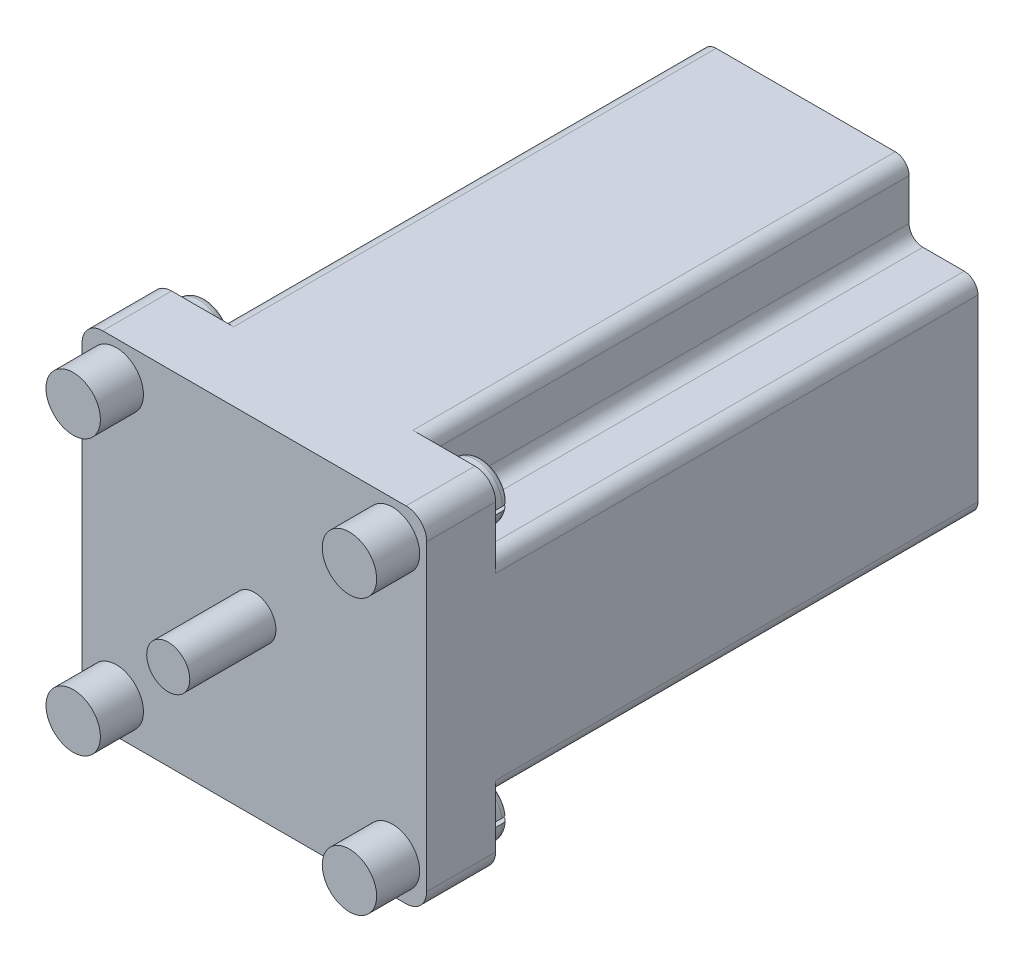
ISO-10303-21;
HEADER;
FILE_DESCRIPTION(('STEP AP214'),'2;1');
FILE_NAME('part.step','',(''),(''),'','','');
FILE_SCHEMA(('AUTOMOTIVE_DESIGN { 1 0 10303 214 1 1 1 1 }'));
ENDSEC;
DATA;
#1=APPLICATION_CONTEXT('core data for automotive mechanical design processes');
#2=APPLICATION_PROTOCOL_DEFINITION('international standard','automotive_design',2000,#1);
#3=PRODUCT_CONTEXT('',#1,'mechanical');
#4=PRODUCT('Part','Part','',(#3));
#5=PRODUCT_RELATED_PRODUCT_CATEGORY('part','',(#4));
#6=PRODUCT_DEFINITION_FORMATION('','',#4);
#7=PRODUCT_DEFINITION_CONTEXT('part definition',#1,'design');
#8=PRODUCT_DEFINITION('design','',#6,#7);
#9=PRODUCT_DEFINITION_SHAPE('','',#8);
#10=(LENGTH_UNIT() NAMED_UNIT(*) SI_UNIT(.MILLI.,.METRE.));
#11=(NAMED_UNIT(*) PLANE_ANGLE_UNIT() SI_UNIT($,.RADIAN.));
#12=(NAMED_UNIT(*) SI_UNIT($,.STERADIAN.) SOLID_ANGLE_UNIT());
#13=UNCERTAINTY_MEASURE_WITH_UNIT(LENGTH_MEASURE(1.E-05),#10,'distance_accuracy_value','');
#14=(GEOMETRIC_REPRESENTATION_CONTEXT(3) GLOBAL_UNCERTAINTY_ASSIGNED_CONTEXT((#13)) GLOBAL_UNIT_ASSIGNED_CONTEXT((#10,
#11,#12)) REPRESENTATION_CONTEXT('',''));
#15=CARTESIAN_POINT('',(0.,0.,0.));
#16=DIRECTION('',(0.,0.,1.));
#17=DIRECTION('',(1.,0.,0.));
#18=AXIS2_PLACEMENT_3D('',#15,#16,#17);
#19=CARTESIAN_POINT('',(32.0668246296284,-31.8813019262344,119.642538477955));
#20=DIRECTION('',(0.,0.,-1.));
#21=DIRECTION('',(-1.,0.,0.));
#22=AXIS2_PLACEMENT_3D('',#19,#20,#21);
#23=CYLINDRICAL_SURFACE('',#22,6.31404582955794);
#24=CARTESIAN_POINT('',(32.0668246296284,-31.8813019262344,103.642538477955));
#25=DIRECTION('',(0.,0.,-1.));
#26=DIRECTION('',(-1.,0.,0.));
#27=AXIS2_PLACEMENT_3D('',#24,#25,#26);
#28=CIRCLE('',#27,6.31404582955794);
#29=CARTESIAN_POINT('',(25.7527788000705,-31.8813019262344,103.642538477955));
#30=VERTEX_POINT('',#29);
#31=EDGE_CURVE('E1449',#30,#30,#28,.F.);
#32=ORIENTED_EDGE('',*,*,#31,.T.);
#33=EDGE_LOOP('',(#32));
#34=FACE_BOUND('',#33,.T.);
#35=CARTESIAN_POINT('',(32.0668246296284,-31.8813019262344,113.642538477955));
#36=DIRECTION('',(0.,0.,1.));
#37=DIRECTION('',(0.,-1.,0.));
#38=AXIS2_PLACEMENT_3D('',#35,#36,#37);
#39=CIRCLE('',#38,6.31404582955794);
#40=CARTESIAN_POINT('',(32.0668246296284,-38.1953477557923,113.642538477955));
#41=VERTEX_POINT('',#40);
#42=EDGE_CURVE('E1178',#41,#41,#39,.T.);
#43=ORIENTED_EDGE('',*,*,#42,.F.);
#44=EDGE_LOOP('',(#43));
#45=FACE_BOUND('',#44,.T.);
#46=ADVANCED_FACE('F36',(#34,#45),#23,.T.);
#47=CARTESIAN_POINT('',(-32.0668246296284,-31.8813019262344,119.642538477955));
#48=DIRECTION('',(0.,0.,-1.));
#49=DIRECTION('',(-1.,0.,0.));
#50=AXIS2_PLACEMENT_3D('',#47,#48,#49);
#51=CYLINDRICAL_SURFACE('',#50,6.31404582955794);
#52=CARTESIAN_POINT('',(-32.0668246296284,-31.8813019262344,103.642538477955));
#53=DIRECTION('',(0.,0.,-1.));
#54=DIRECTION('',(-1.,0.,0.));
#55=AXIS2_PLACEMENT_3D('',#52,#53,#54);
#56=CIRCLE('',#55,6.31404582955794);
#57=CARTESIAN_POINT('',(-38.3808704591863,-31.8813019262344,103.642538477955));
#58=VERTEX_POINT('',#57);
#59=EDGE_CURVE('E408',#58,#58,#56,.T.);
#60=ORIENTED_EDGE('',*,*,#59,.F.);
#61=EDGE_LOOP('',(#60));
#62=FACE_BOUND('',#61,.T.);
#63=CARTESIAN_POINT('',(-32.0668246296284,-31.8813019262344,113.642538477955));
#64=DIRECTION('',(0.,0.,1.));
#65=DIRECTION('',(0.,-1.,0.));
#66=AXIS2_PLACEMENT_3D('',#63,#64,#65);
#67=CIRCLE('',#66,6.31404582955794);
#68=CARTESIAN_POINT('',(-32.0668246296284,-38.1953477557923,113.642538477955));
#69=VERTEX_POINT('',#68);
#70=EDGE_CURVE('E40',#69,#69,#67,.F.);
#71=ORIENTED_EDGE('',*,*,#70,.T.);
#72=EDGE_LOOP('',(#71));
#73=FACE_BOUND('',#72,.T.);
#74=ADVANCED_FACE('F941',(#62,#73),#51,.T.);
#75=CARTESIAN_POINT('',(32.0668246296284,31.8813019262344,119.642538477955));
#76=DIRECTION('',(0.,0.,-1.));
#77=DIRECTION('',(-1.,0.,0.));
#78=AXIS2_PLACEMENT_3D('',#75,#76,#77);
#79=CYLINDRICAL_SURFACE('',#78,6.31404582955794);
#80=CARTESIAN_POINT('',(32.0668246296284,31.8813019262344,103.642538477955));
#81=DIRECTION('',(0.,0.,-1.));
#82=DIRECTION('',(-1.,0.,0.));
#83=AXIS2_PLACEMENT_3D('',#80,#81,#82);
#84=CIRCLE('',#83,6.31404582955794);
#85=CARTESIAN_POINT('',(25.7527788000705,31.8813019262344,103.642538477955));
#86=VERTEX_POINT('',#85);
#87=EDGE_CURVE('E487',#86,#86,#84,.T.);
#88=ORIENTED_EDGE('',*,*,#87,.F.);
#89=EDGE_LOOP('',(#88));
#90=FACE_BOUND('',#89,.T.);
#91=CARTESIAN_POINT('',(32.0668246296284,31.8813019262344,113.642538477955));
#92=DIRECTION('',(0.,0.,1.));
#93=DIRECTION('',(1.,0.,0.));
#94=AXIS2_PLACEMENT_3D('',#91,#92,#93);
#95=CIRCLE('',#94,6.31404582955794);
#96=CARTESIAN_POINT('',(38.3808704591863,31.8813019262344,113.642538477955));
#97=VERTEX_POINT('',#96);
#98=EDGE_CURVE('E1177',#97,#97,#95,.F.);
#99=ORIENTED_EDGE('',*,*,#98,.T.);
#100=EDGE_LOOP('',(#99));
#101=FACE_BOUND('',#100,.T.);
#102=ADVANCED_FACE('F870',(#90,#101),#79,.T.);
#103=CARTESIAN_POINT('',(-32.0668246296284,31.8813019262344,119.642538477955));
#104=DIRECTION('',(0.,0.,-1.));
#105=DIRECTION('',(-1.,0.,0.));
#106=AXIS2_PLACEMENT_3D('',#103,#104,#105);
#107=CYLINDRICAL_SURFACE('',#106,6.31404582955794);
#108=CARTESIAN_POINT('',(-32.0668246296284,31.8813019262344,103.642538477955));
#109=DIRECTION('',(0.,0.,-1.));
#110=DIRECTION('',(-1.,0.,0.));
#111=AXIS2_PLACEMENT_3D('',#108,#109,#110);
#112=CIRCLE('',#111,6.31404582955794);
#113=CARTESIAN_POINT('',(-38.3808704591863,31.8813019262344,103.642538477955));
#114=VERTEX_POINT('',#113);
#115=EDGE_CURVE('E431',#114,#114,#112,.F.);
#116=ORIENTED_EDGE('',*,*,#115,.T.);
#117=EDGE_LOOP('',(#116));
#118=FACE_BOUND('',#117,.T.);
#119=CARTESIAN_POINT('',(-32.0668246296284,31.8813019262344,113.642538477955));
#120=DIRECTION('',(0.,0.,1.));
#121=DIRECTION('',(1.,0.,0.));
#122=AXIS2_PLACEMENT_3D('',#119,#120,#121);
#123=CIRCLE('',#122,6.31404582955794);
#124=CARTESIAN_POINT('',(-25.7527788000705,31.8813019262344,113.642538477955));
#125=VERTEX_POINT('',#124);
#126=EDGE_CURVE('E1175',#125,#125,#123,.T.);
#127=ORIENTED_EDGE('',*,*,#126,.F.);
#128=EDGE_LOOP('',(#127));
#129=FACE_BOUND('',#128,.T.);
#130=ADVANCED_FACE('F1164',(#118,#129),#107,.T.);
#131=CARTESIAN_POINT('',(35.2,35.2,103.642538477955));
#132=DIRECTION('',(0.,0.,-1.));
#133=DIRECTION('',(-1.,0.,0.));
#134=AXIS2_PLACEMENT_3D('',#131,#132,#133);
#135=PLANE('',#134);
#136=ORIENTED_EDGE('',*,*,#115,.F.);
#137=EDGE_LOOP('',(#136));
#138=FACE_BOUND('',#137,.T.);
#139=CARTESIAN_POINT('',(35.2,35.2,103.642538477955));
#140=DIRECTION('',(0.,0.,1.));
#141=DIRECTION('',(-1.,0.,0.));
#142=AXIS2_PLACEMENT_3D('',#139,#140,#141);
#143=CIRCLE('',#142,4.8);
#144=CARTESIAN_POINT('',(40.,35.2,103.642538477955));
#145=VERTEX_POINT('',#144);
#146=CARTESIAN_POINT('',(35.2,40.,103.642538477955));
#147=VERTEX_POINT('',#146);
#148=EDGE_CURVE('E515',#145,#147,#143,.T.);
#149=ORIENTED_EDGE('',*,*,#148,.T.);
#150=DIRECTION('',(-1.,0.,0.));
#151=VECTOR('',#150,1.);
#152=CARTESIAN_POINT('',(-35.2,40.,103.642538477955));
#153=LINE('',#152,#151);
#154=CARTESIAN_POINT('',(-35.2,40.,103.642538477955));
#155=VERTEX_POINT('',#154);
#156=EDGE_CURVE('E518',#147,#155,#153,.T.);
#157=ORIENTED_EDGE('',*,*,#156,.T.);
#158=CARTESIAN_POINT('',(-35.2,35.2,103.642538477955));
#159=DIRECTION('',(0.,0.,1.));
#160=DIRECTION('',(-1.,0.,0.));
#161=AXIS2_PLACEMENT_3D('',#158,#159,#160);
#162=CIRCLE('',#161,4.8);
#163=CARTESIAN_POINT('',(-40.,35.2,103.642538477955));
#164=VERTEX_POINT('',#163);
#165=EDGE_CURVE('E521',#155,#164,#162,.T.);
#166=ORIENTED_EDGE('',*,*,#165,.T.);
#167=DIRECTION('',(0.,-1.,0.));
#168=VECTOR('',#167,1.);
#169=CARTESIAN_POINT('',(-40.,35.2,103.642538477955));
#170=LINE('',#169,#168);
#171=CARTESIAN_POINT('',(-40.,-35.2,103.642538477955));
#172=VERTEX_POINT('',#171);
#173=EDGE_CURVE('E523',#164,#172,#170,.T.);
#174=ORIENTED_EDGE('',*,*,#173,.T.);
#175=CARTESIAN_POINT('',(-35.2,-35.2,103.642538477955));
#176=DIRECTION('',(0.,0.,1.));
#177=DIRECTION('',(-1.,0.,0.));
#178=AXIS2_PLACEMENT_3D('',#175,#176,#177);
#179=CIRCLE('',#178,4.8);
#180=CARTESIAN_POINT('',(-35.2,-40.,103.642538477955));
#181=VERTEX_POINT('',#180);
#182=EDGE_CURVE('E525',#172,#181,#179,.T.);
#183=ORIENTED_EDGE('',*,*,#182,.T.);
#184=DIRECTION('',(1.,0.,0.));
#185=VECTOR('',#184,1.);
#186=CARTESIAN_POINT('',(-35.2,-40.,103.642538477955));
#187=LINE('',#186,#185);
#188=CARTESIAN_POINT('',(35.2,-40.,103.642538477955));
#189=VERTEX_POINT('',#188);
#190=EDGE_CURVE('E527',#181,#189,#187,.T.);
#191=ORIENTED_EDGE('',*,*,#190,.T.);
#192=CARTESIAN_POINT('',(35.2,-35.2,103.642538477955));
#193=DIRECTION('',(0.,0.,1.));
#194=DIRECTION('',(-1.,0.,0.));
#195=AXIS2_PLACEMENT_3D('',#192,#193,#194);
#196=CIRCLE('',#195,4.8);
#197=CARTESIAN_POINT('',(40.,-35.2,103.642538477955));
#198=VERTEX_POINT('',#197);
#199=EDGE_CURVE('E529',#189,#198,#196,.T.);
#200=ORIENTED_EDGE('',*,*,#199,.T.);
#201=DIRECTION('',(0.,1.,0.));
#202=VECTOR('',#201,1.);
#203=CARTESIAN_POINT('',(40.,35.2,103.642538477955));
#204=LINE('',#203,#202);
#205=EDGE_CURVE('E531',#198,#145,#204,.T.);
#206=ORIENTED_EDGE('',*,*,#205,.T.);
#207=EDGE_LOOP('',(#149,#157,#166,#174,#183,#191,#200,#206));
#208=FACE_BOUND('',#207,.T.);
#209=ORIENTED_EDGE('',*,*,#87,.T.);
#210=EDGE_LOOP('',(#209));
#211=FACE_BOUND('',#210,.T.);
#212=ORIENTED_EDGE('',*,*,#31,.F.);
#213=EDGE_LOOP('',(#212));
#214=FACE_BOUND('',#213,.T.);
#215=ORIENTED_EDGE('',*,*,#59,.T.);
#216=EDGE_LOOP('',(#215));
#217=FACE_BOUND('',#216,.T.);
#218=CARTESIAN_POINT('',(0.,0.,103.642538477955));
#219=DIRECTION('',(0.,0.,-1.));
#220=DIRECTION('',(-1.,0.,0.));
#221=AXIS2_PLACEMENT_3D('',#218,#219,#220);
#222=CIRCLE('',#221,5.);
#223=CARTESIAN_POINT('',(-5.,0.,103.642538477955));
#224=VERTEX_POINT('',#223);
#225=EDGE_CURVE('E11',#224,#224,#222,.F.);
#226=ORIENTED_EDGE('',*,*,#225,.F.);
#227=EDGE_LOOP('',(#226));
#228=FACE_BOUND('',#227,.T.);
#229=ADVANCED_FACE('F993',(#138,#208,#211,#214,#217,#228),#135,.F.);
#230=CARTESIAN_POINT('',(20.8,36.8,-24.3574615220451));
#231=DIRECTION('',(0.,0.,-1.));
#232=DIRECTION('',(-1.,0.,0.));
#233=AXIS2_PLACEMENT_3D('',#230,#231,#232);
#234=PLANE('',#233);
#235=CARTESIAN_POINT('',(20.8,36.8,-24.3574615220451));
#236=DIRECTION('',(0.,0.,1.));
#237=DIRECTION('',(-1.,0.,0.));
#238=AXIS2_PLACEMENT_3D('',#235,#236,#237);
#239=CIRCLE('',#238,3.2);
#240=CARTESIAN_POINT('',(24.,36.8,-24.3574615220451));
#241=VERTEX_POINT('',#240);
#242=CARTESIAN_POINT('',(20.8,40.,-24.3574615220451));
#243=VERTEX_POINT('',#242);
#244=EDGE_CURVE('E594',#241,#243,#239,.T.);
#245=ORIENTED_EDGE('',*,*,#244,.F.);
#246=DIRECTION('',(0.,1.,0.));
#247=VECTOR('',#246,1.);
#248=CARTESIAN_POINT('',(24.,36.8,-24.3574615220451));
#249=LINE('',#248,#247);
#250=CARTESIAN_POINT('',(24.,27.2,-24.3574615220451));
#251=VERTEX_POINT('',#250);
#252=EDGE_CURVE('E650',#251,#241,#249,.T.);
#253=ORIENTED_EDGE('',*,*,#252,.F.);
#254=CARTESIAN_POINT('',(27.2,27.2,-24.3574615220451));
#255=DIRECTION('',(0.,0.,-1.));
#256=DIRECTION('',(1.,0.,0.));
#257=AXIS2_PLACEMENT_3D('',#254,#255,#256);
#258=CIRCLE('',#257,3.2);
#259=CARTESIAN_POINT('',(27.2,24.,-24.3574615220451));
#260=VERTEX_POINT('',#259);
#261=EDGE_CURVE('E648',#260,#251,#258,.T.);
#262=ORIENTED_EDGE('',*,*,#261,.F.);
#263=DIRECTION('',(-1.,0.,0.));
#264=VECTOR('',#263,1.);
#265=CARTESIAN_POINT('',(27.2,24.,-24.3574615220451));
#266=LINE('',#265,#264);
#267=CARTESIAN_POINT('',(36.8,24.,-24.3574615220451));
#268=VERTEX_POINT('',#267);
#269=EDGE_CURVE('E646',#268,#260,#266,.T.);
#270=ORIENTED_EDGE('',*,*,#269,.F.);
#271=CARTESIAN_POINT('',(36.8,20.8,-24.3574615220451));
#272=DIRECTION('',(0.,0.,1.));
#273=DIRECTION('',(-1.,0.,0.));
#274=AXIS2_PLACEMENT_3D('',#271,#272,#273);
#275=CIRCLE('',#274,3.2);
#276=CARTESIAN_POINT('',(40.,20.8,-24.3574615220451));
#277=VERTEX_POINT('',#276);
#278=EDGE_CURVE('E644',#277,#268,#275,.T.);
#279=ORIENTED_EDGE('',*,*,#278,.F.);
#280=DIRECTION('',(0.,1.,0.));
#281=VECTOR('',#280,1.);
#282=CARTESIAN_POINT('',(40.,20.8,-24.3574615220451));
#283=LINE('',#282,#281);
#284=CARTESIAN_POINT('',(40.,-20.8,-24.3574615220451));
#285=VERTEX_POINT('',#284);
#286=EDGE_CURVE('E642',#285,#277,#283,.T.);
#287=ORIENTED_EDGE('',*,*,#286,.F.);
#288=CARTESIAN_POINT('',(36.8,-20.8,-24.3574615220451));
#289=DIRECTION('',(0.,0.,1.));
#290=DIRECTION('',(-1.,0.,0.));
#291=AXIS2_PLACEMENT_3D('',#288,#289,#290);
#292=CIRCLE('',#291,3.2);
#293=CARTESIAN_POINT('',(36.8,-24.,-24.3574615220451));
#294=VERTEX_POINT('',#293);
#295=EDGE_CURVE('E640',#294,#285,#292,.T.);
#296=ORIENTED_EDGE('',*,*,#295,.F.);
#297=DIRECTION('',(1.,0.,0.));
#298=VECTOR('',#297,1.);
#299=CARTESIAN_POINT('',(27.2,-24.,-24.3574615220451));
#300=LINE('',#299,#298);
#301=CARTESIAN_POINT('',(27.2,-24.,-24.3574615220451));
#302=VERTEX_POINT('',#301);
#303=EDGE_CURVE('E638',#302,#294,#300,.T.);
#304=ORIENTED_EDGE('',*,*,#303,.F.);
#305=CARTESIAN_POINT('',(27.2,-27.2,-24.3574615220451));
#306=DIRECTION('',(0.,0.,-1.));
#307=DIRECTION('',(1.,0.,0.));
#308=AXIS2_PLACEMENT_3D('',#305,#306,#307);
#309=CIRCLE('',#308,3.2);
#310=CARTESIAN_POINT('',(24.,-27.2,-24.3574615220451));
#311=VERTEX_POINT('',#310);
#312=EDGE_CURVE('E636',#311,#302,#309,.T.);
#313=ORIENTED_EDGE('',*,*,#312,.F.);
#314=DIRECTION('',(0.,1.,0.));
#315=VECTOR('',#314,1.);
#316=CARTESIAN_POINT('',(24.,-36.8,-24.3574615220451));
#317=LINE('',#316,#315);
#318=CARTESIAN_POINT('',(24.,-36.8,-24.3574615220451));
#319=VERTEX_POINT('',#318);
#320=EDGE_CURVE('E634',#319,#311,#317,.T.);
#321=ORIENTED_EDGE('',*,*,#320,.F.);
#322=CARTESIAN_POINT('',(20.8,-36.8,-24.3574615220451));
#323=DIRECTION('',(0.,0.,1.));
#324=DIRECTION('',(-1.,0.,0.));
#325=AXIS2_PLACEMENT_3D('',#322,#323,#324);
#326=CIRCLE('',#325,3.2);
#327=CARTESIAN_POINT('',(20.8,-40.,-24.3574615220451));
#328=VERTEX_POINT('',#327);
#329=EDGE_CURVE('E632',#328,#319,#326,.T.);
#330=ORIENTED_EDGE('',*,*,#329,.F.);
#331=DIRECTION('',(1.,0.,0.));
#332=VECTOR('',#331,1.);
#333=CARTESIAN_POINT('',(-20.8,-40.,-24.3574615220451));
#334=LINE('',#333,#332);
#335=CARTESIAN_POINT('',(-20.8,-40.,-24.3574615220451));
#336=VERTEX_POINT('',#335);
#337=EDGE_CURVE('E630',#336,#328,#334,.T.);
#338=ORIENTED_EDGE('',*,*,#337,.F.);
#339=CARTESIAN_POINT('',(-20.8,-36.8,-24.3574615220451));
#340=DIRECTION('',(0.,0.,1.));
#341=DIRECTION('',(-1.,0.,0.));
#342=AXIS2_PLACEMENT_3D('',#339,#340,#341);
#343=CIRCLE('',#342,3.2);
#344=CARTESIAN_POINT('',(-24.,-36.8,-24.3574615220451));
#345=VERTEX_POINT('',#344);
#346=EDGE_CURVE('E628',#345,#336,#343,.T.);
#347=ORIENTED_EDGE('',*,*,#346,.F.);
#348=DIRECTION('',(0.,-1.,0.));
#349=VECTOR('',#348,1.);
#350=CARTESIAN_POINT('',(-24.,-36.8,-24.3574615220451));
#351=LINE('',#350,#349);
#352=CARTESIAN_POINT('',(-24.,-27.2,-24.3574615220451));
#353=VERTEX_POINT('',#352);
#354=EDGE_CURVE('E626',#353,#345,#351,.T.);
#355=ORIENTED_EDGE('',*,*,#354,.F.);
#356=CARTESIAN_POINT('',(-27.2,-27.2,-24.3574615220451));
#357=DIRECTION('',(0.,0.,-1.));
#358=DIRECTION('',(1.,0.,0.));
#359=AXIS2_PLACEMENT_3D('',#356,#357,#358);
#360=CIRCLE('',#359,3.2);
#361=CARTESIAN_POINT('',(-27.2,-24.,-24.3574615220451));
#362=VERTEX_POINT('',#361);
#363=EDGE_CURVE('E624',#362,#353,#360,.T.);
#364=ORIENTED_EDGE('',*,*,#363,.F.);
#365=DIRECTION('',(1.,0.,0.));
#366=VECTOR('',#365,1.);
#367=CARTESIAN_POINT('',(-27.2,-24.,-24.3574615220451));
#368=LINE('',#367,#366);
#369=CARTESIAN_POINT('',(-36.8,-24.,-24.3574615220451));
#370=VERTEX_POINT('',#369);
#371=EDGE_CURVE('E622',#370,#362,#368,.T.);
#372=ORIENTED_EDGE('',*,*,#371,.F.);
#373=CARTESIAN_POINT('',(-36.8,-20.8,-24.3574615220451));
#374=DIRECTION('',(0.,0.,1.));
#375=DIRECTION('',(-1.,0.,0.));
#376=AXIS2_PLACEMENT_3D('',#373,#374,#375);
#377=CIRCLE('',#376,3.2);
#378=CARTESIAN_POINT('',(-40.,-20.8,-24.3574615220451));
#379=VERTEX_POINT('',#378);
#380=EDGE_CURVE('E620',#379,#370,#377,.T.);
#381=ORIENTED_EDGE('',*,*,#380,.F.);
#382=DIRECTION('',(0.,-1.,0.));
#383=VECTOR('',#382,1.);
#384=CARTESIAN_POINT('',(-40.,20.8,-24.3574615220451));
#385=LINE('',#384,#383);
#386=CARTESIAN_POINT('',(-40.,20.8,-24.3574615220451));
#387=VERTEX_POINT('',#386);
#388=EDGE_CURVE('E618',#387,#379,#385,.T.);
#389=ORIENTED_EDGE('',*,*,#388,.F.);
#390=CARTESIAN_POINT('',(-36.8,20.8,-24.3574615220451));
#391=DIRECTION('',(0.,0.,1.));
#392=DIRECTION('',(-1.,0.,0.));
#393=AXIS2_PLACEMENT_3D('',#390,#391,#392);
#394=CIRCLE('',#393,3.2);
#395=CARTESIAN_POINT('',(-36.8,24.,-24.3574615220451));
#396=VERTEX_POINT('',#395);
#397=EDGE_CURVE('E616',#396,#387,#394,.T.);
#398=ORIENTED_EDGE('',*,*,#397,.F.);
#399=DIRECTION('',(-1.,0.,0.));
#400=VECTOR('',#399,1.);
#401=CARTESIAN_POINT('',(-27.2,24.,-24.3574615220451));
#402=LINE('',#401,#400);
#403=CARTESIAN_POINT('',(-27.2,24.,-24.3574615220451));
#404=VERTEX_POINT('',#403);
#405=EDGE_CURVE('E614',#404,#396,#402,.T.);
#406=ORIENTED_EDGE('',*,*,#405,.F.);
#407=CARTESIAN_POINT('',(-27.2,27.2,-24.3574615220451));
#408=DIRECTION('',(0.,0.,-1.));
#409=DIRECTION('',(1.,0.,0.));
#410=AXIS2_PLACEMENT_3D('',#407,#408,#409);
#411=CIRCLE('',#410,3.2);
#412=CARTESIAN_POINT('',(-24.,27.2,-24.3574615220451));
#413=VERTEX_POINT('',#412);
#414=EDGE_CURVE('E612',#413,#404,#411,.T.);
#415=ORIENTED_EDGE('',*,*,#414,.F.);
#416=DIRECTION('',(0.,-1.,0.));
#417=VECTOR('',#416,1.);
#418=CARTESIAN_POINT('',(-24.,36.8,-24.3574615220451));
#419=LINE('',#418,#417);
#420=CARTESIAN_POINT('',(-24.,36.8,-24.3574615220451));
#421=VERTEX_POINT('',#420);
#422=EDGE_CURVE('E610',#421,#413,#419,.T.);
#423=ORIENTED_EDGE('',*,*,#422,.F.);
#424=CARTESIAN_POINT('',(-20.8,36.8,-24.3574615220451));
#425=DIRECTION('',(0.,0.,1.));
#426=DIRECTION('',(-1.,0.,0.));
#427=AXIS2_PLACEMENT_3D('',#424,#425,#426);
#428=CIRCLE('',#427,3.2);
#429=CARTESIAN_POINT('',(-20.8,40.,-24.3574615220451));
#430=VERTEX_POINT('',#429);
#431=EDGE_CURVE('E603',#430,#421,#428,.T.);
#432=ORIENTED_EDGE('',*,*,#431,.F.);
#433=DIRECTION('',(-1.,0.,0.));
#434=VECTOR('',#433,1.);
#435=CARTESIAN_POINT('',(-20.8,40.,-24.3574615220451));
#436=LINE('',#435,#434);
#437=EDGE_CURVE('E598',#243,#430,#436,.T.);
#438=ORIENTED_EDGE('',*,*,#437,.F.);
#439=EDGE_LOOP('',(#245,#253,#262,#270,#279,#287,#296,#304,#313,#321,#330,#338,#347,#355,#364,
#372,#381,#389,#398,#406,#415,#423,#432,#438));
#440=FACE_BOUND('',#439,.T.);
#441=CARTESIAN_POINT('',(0.,0.,-24.3574615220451));
#442=DIRECTION('',(0.,0.,-1.));
#443=DIRECTION('',(-1.,0.,0.));
#444=AXIS2_PLACEMENT_3D('',#441,#442,#443);
#445=CIRCLE('',#444,31.3597800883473);
#446=CARTESIAN_POINT('',(-31.3597800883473,0.,-24.3574615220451));
#447=VERTEX_POINT('',#446);
#448=EDGE_CURVE('E1455',#447,#447,#445,.T.);
#449=ORIENTED_EDGE('',*,*,#448,.F.);
#450=EDGE_LOOP('',(#449));
#451=FACE_BOUND('',#450,.T.);
#452=ADVANCED_FACE('F742',(#440,#451),#234,.T.);
#453=CARTESIAN_POINT('',(35.2,35.2,87.6425384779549));
#454=DIRECTION('',(0.,0.,-1.));
#455=DIRECTION('',(-1.,0.,0.));
#456=AXIS2_PLACEMENT_3D('',#453,#454,#455);
#457=PLANE('',#456);
#458=CARTESIAN_POINT('',(-32.0668246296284,-31.8813019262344,87.6425384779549));
#459=DIRECTION('',(0.,0.,-1.));
#460=DIRECTION('',(1.,0.,0.));
#461=AXIS2_PLACEMENT_3D('',#458,#459,#460);
#462=CIRCLE('',#461,6.31404582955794);
#463=CARTESIAN_POINT('',(-38.2972894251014,-30.8573472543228,87.6425384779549));
#464=VERTEX_POINT('',#463);
#465=CARTESIAN_POINT('',(-25.7527788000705,-31.8813019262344,87.6425384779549));
#466=VERTEX_POINT('',#465);
#467=EDGE_CURVE('E405',#464,#466,#462,.T.);
#468=ORIENTED_EDGE('',*,*,#467,.F.);
#469=DIRECTION('',(-0.996685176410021,0.0813551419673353,0.));
#470=VECTOR('',#469,1.);
#471=CARTESIAN_POINT('',(-25.7527788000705,-31.8813019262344,87.6425384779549));
#472=LINE('',#471,#470);
#473=EDGE_CURVE('E397',#466,#464,#472,.T.);
#474=ORIENTED_EDGE('',*,*,#473,.F.);
#475=EDGE_LOOP('',(#468,#474));
#476=FACE_BOUND('',#475,.T.);
#477=DIRECTION('',(0.996395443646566,-0.084829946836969,0.));
#478=VECTOR('',#477,1.);
#479=CARTESIAN_POINT('',(-25.8436520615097,-32.9486809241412,87.6425384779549));
#480=LINE('',#479,#478);
#481=CARTESIAN_POINT('',(-38.3808704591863,-31.8813019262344,87.6425384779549));
#482=VERTEX_POINT('',#481);
#483=CARTESIAN_POINT('',(-25.8436520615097,-32.9486809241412,87.6425384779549));
#484=VERTEX_POINT('',#483);
#485=EDGE_CURVE('E422',#482,#484,#480,.T.);
#486=ORIENTED_EDGE('',*,*,#485,.F.);
#487=CARTESIAN_POINT('',(-32.0668246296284,-31.8813019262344,87.6425384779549));
#488=DIRECTION('',(0.,0.,-1.));
#489=DIRECTION('',(1.,0.,0.));
#490=AXIS2_PLACEMENT_3D('',#487,#488,#489);
#491=CIRCLE('',#490,6.31404582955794);
#492=EDGE_CURVE('E402',#484,#482,#491,.T.);
#493=ORIENTED_EDGE('',*,*,#492,.F.);
#494=EDGE_LOOP('',(#486,#493));
#495=FACE_BOUND('',#494,.T.);
#496=DIRECTION('',(0.,-1.,0.));
#497=VECTOR('',#496,1.);
#498=CARTESIAN_POINT('',(-40.,35.2,87.6425384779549));
#499=LINE('',#498,#497);
#500=CARTESIAN_POINT('',(-40.,-20.8,87.6425384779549));
#501=VERTEX_POINT('',#500);
#502=CARTESIAN_POINT('',(-40.,-35.2,87.6425384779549));
#503=VERTEX_POINT('',#502);
#504=EDGE_CURVE('E548',#501,#503,#499,.T.);
#505=ORIENTED_EDGE('',*,*,#504,.F.);
#506=CARTESIAN_POINT('',(-36.8,-20.8,87.6425384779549));
#507=DIRECTION('',(0.,0.,1.));
#508=DIRECTION('',(-1.,0.,0.));
#509=AXIS2_PLACEMENT_3D('',#506,#507,#508);
#510=CIRCLE('',#509,3.2);
#511=CARTESIAN_POINT('',(-36.8,-24.,87.6425384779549));
#512=VERTEX_POINT('',#511);
#513=EDGE_CURVE('E1938',#501,#512,#510,.T.);
#514=ORIENTED_EDGE('',*,*,#513,.T.);
#515=DIRECTION('',(1.,0.,0.));
#516=VECTOR('',#515,1.);
#517=CARTESIAN_POINT('',(-27.2,-24.,87.6425384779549));
#518=LINE('',#517,#516);
#519=CARTESIAN_POINT('',(-27.2,-24.,87.6425384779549));
#520=VERTEX_POINT('',#519);
#521=EDGE_CURVE('E1935',#512,#520,#518,.T.);
#522=ORIENTED_EDGE('',*,*,#521,.T.);
#523=CARTESIAN_POINT('',(-27.2,-27.2,87.6425384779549));
#524=DIRECTION('',(0.,0.,-1.));
#525=DIRECTION('',(1.,0.,0.));
#526=AXIS2_PLACEMENT_3D('',#523,#524,#525);
#527=CIRCLE('',#526,3.2);
#528=CARTESIAN_POINT('',(-24.,-27.2,87.6425384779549));
#529=VERTEX_POINT('',#528);
#530=EDGE_CURVE('E1015',#520,#529,#527,.T.);
#531=ORIENTED_EDGE('',*,*,#530,.T.);
#532=DIRECTION('',(0.,-1.,0.));
#533=VECTOR('',#532,1.);
#534=CARTESIAN_POINT('',(-24.,-36.8,87.6425384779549));
#535=LINE('',#534,#533);
#536=CARTESIAN_POINT('',(-24.,-36.8,87.6425384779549));
#537=VERTEX_POINT('',#536);
#538=EDGE_CURVE('E1010',#529,#537,#535,.T.);
#539=ORIENTED_EDGE('',*,*,#538,.T.);
#540=CARTESIAN_POINT('',(-20.8,-36.8,87.6425384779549));
#541=DIRECTION('',(0.,0.,1.));
#542=DIRECTION('',(-1.,0.,0.));
#543=AXIS2_PLACEMENT_3D('',#540,#541,#542);
#544=CIRCLE('',#543,3.2);
#545=CARTESIAN_POINT('',(-20.8,-40.,87.6425384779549));
#546=VERTEX_POINT('',#545);
#547=EDGE_CURVE('E1007',#537,#546,#544,.T.);
#548=ORIENTED_EDGE('',*,*,#547,.T.);
#549=DIRECTION('',(1.,0.,0.));
#550=VECTOR('',#549,1.);
#551=CARTESIAN_POINT('',(-35.2,-40.,87.6425384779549));
#552=LINE('',#551,#550);
#553=CARTESIAN_POINT('',(-35.2,-40.,87.6425384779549));
#554=VERTEX_POINT('',#553);
#555=EDGE_CURVE('E564',#554,#546,#552,.T.);
#556=ORIENTED_EDGE('',*,*,#555,.F.);
#557=CARTESIAN_POINT('',(-35.2,-35.2,87.6425384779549));
#558=DIRECTION('',(0.,0.,1.));
#559=DIRECTION('',(-1.,0.,0.));
#560=AXIS2_PLACEMENT_3D('',#557,#558,#559);
#561=CIRCLE('',#560,4.8);
#562=EDGE_CURVE('E554',#503,#554,#561,.T.);
#563=ORIENTED_EDGE('',*,*,#562,.F.);
#564=EDGE_LOOP('',(#505,#514,#522,#531,#539,#548,#556,#563));
#565=FACE_BOUND('',#564,.T.);
#566=ADVANCED_FACE('F410',(#476,#495,#565),#457,.T.);
#567=CARTESIAN_POINT('',(32.0668246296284,31.8813019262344,87.6425384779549));
#568=DIRECTION('',(0.,0.,-1.));
#569=DIRECTION('',(-1.,0.,0.));
#570=AXIS2_PLACEMENT_3D('',#567,#568,#569);
#571=CIRCLE('',#570,6.31404582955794);
#572=CARTESIAN_POINT('',(25.8436520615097,32.9486809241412,87.6425384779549));
#573=VERTEX_POINT('',#572);
#574=CARTESIAN_POINT('',(38.3808704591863,31.8813019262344,87.6425384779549));
#575=VERTEX_POINT('',#574);
#576=EDGE_CURVE('E501',#573,#575,#571,.T.);
#577=ORIENTED_EDGE('',*,*,#576,.F.);
#578=DIRECTION('',(-0.996395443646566,0.084829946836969,0.));
#579=VECTOR('',#578,1.);
#580=CARTESIAN_POINT('',(25.8436520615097,32.9486809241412,87.6425384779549));
#581=LINE('',#580,#579);
#582=EDGE_CURVE('E506',#575,#573,#581,.T.);
#583=ORIENTED_EDGE('',*,*,#582,.F.);
#584=EDGE_LOOP('',(#577,#583));
#585=FACE_BOUND('',#584,.T.);
#586=DIRECTION('',(0.996685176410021,-0.0813551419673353,0.));
#587=VECTOR('',#586,1.);
#588=CARTESIAN_POINT('',(25.7527788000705,31.8813019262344,87.6425384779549));
#589=LINE('',#588,#587);
#590=CARTESIAN_POINT('',(25.7527788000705,31.8813019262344,87.6425384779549));
#591=VERTEX_POINT('',#590);
#592=CARTESIAN_POINT('',(38.2972894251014,30.8573472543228,87.6425384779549));
#593=VERTEX_POINT('',#592);
#594=EDGE_CURVE('E492',#591,#593,#589,.T.);
#595=ORIENTED_EDGE('',*,*,#594,.F.);
#596=CARTESIAN_POINT('',(32.0668246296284,31.8813019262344,87.6425384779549));
#597=DIRECTION('',(0.,0.,-1.));
#598=DIRECTION('',(-1.,0.,0.));
#599=AXIS2_PLACEMENT_3D('',#596,#597,#598);
#600=CIRCLE('',#599,6.31404582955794);
#601=EDGE_CURVE('E493',#593,#591,#600,.T.);
#602=ORIENTED_EDGE('',*,*,#601,.F.);
#603=EDGE_LOOP('',(#595,#602));
#604=FACE_BOUND('',#603,.T.);
#605=DIRECTION('',(0.,1.,0.));
#606=VECTOR('',#605,1.);
#607=CARTESIAN_POINT('',(24.,36.8,87.6425384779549));
#608=LINE('',#607,#606);
#609=CARTESIAN_POINT('',(24.,27.2,87.6425384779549));
#610=VERTEX_POINT('',#609);
#611=CARTESIAN_POINT('',(24.,36.8,87.6425384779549));
#612=VERTEX_POINT('',#611);
#613=EDGE_CURVE('E606',#610,#612,#608,.T.);
#614=ORIENTED_EDGE('',*,*,#613,.T.);
#615=CARTESIAN_POINT('',(20.8,36.8,87.6425384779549));
#616=DIRECTION('',(0.,0.,1.));
#617=DIRECTION('',(-1.,0.,0.));
#618=AXIS2_PLACEMENT_3D('',#615,#616,#617);
#619=CIRCLE('',#618,3.2);
#620=CARTESIAN_POINT('',(20.8,40.,87.6425384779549));
#621=VERTEX_POINT('',#620);
#622=EDGE_CURVE('E652',#612,#621,#619,.T.);
#623=ORIENTED_EDGE('',*,*,#622,.T.);
#624=DIRECTION('',(-1.,0.,0.));
#625=VECTOR('',#624,1.);
#626=CARTESIAN_POINT('',(-35.2,40.,87.6425384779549));
#627=LINE('',#626,#625);
#628=CARTESIAN_POINT('',(35.2,40.,87.6425384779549));
#629=VERTEX_POINT('',#628);
#630=EDGE_CURVE('E545',#629,#621,#627,.T.);
#631=ORIENTED_EDGE('',*,*,#630,.F.);
#632=CARTESIAN_POINT('',(35.2,35.2,87.6425384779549));
#633=DIRECTION('',(0.,0.,1.));
#634=DIRECTION('',(-1.,0.,0.));
#635=AXIS2_PLACEMENT_3D('',#632,#633,#634);
#636=CIRCLE('',#635,4.8);
#637=CARTESIAN_POINT('',(40.,35.2,87.6425384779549));
#638=VERTEX_POINT('',#637);
#639=EDGE_CURVE('E514',#638,#629,#636,.T.);
#640=ORIENTED_EDGE('',*,*,#639,.F.);
#641=DIRECTION('',(0.,1.,0.));
#642=VECTOR('',#641,1.);
#643=CARTESIAN_POINT('',(40.,35.2,87.6425384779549));
#644=LINE('',#643,#642);
#645=CARTESIAN_POINT('',(40.,20.8,87.6425384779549));
#646=VERTEX_POINT('',#645);
#647=EDGE_CURVE('E567',#646,#638,#644,.T.);
#648=ORIENTED_EDGE('',*,*,#647,.F.);
#649=CARTESIAN_POINT('',(36.8,20.8,87.6425384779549));
#650=DIRECTION('',(0.,0.,1.));
#651=DIRECTION('',(-1.,0.,0.));
#652=AXIS2_PLACEMENT_3D('',#649,#650,#651);
#653=CIRCLE('',#652,3.2);
#654=CARTESIAN_POINT('',(36.8,24.,87.6425384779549));
#655=VERTEX_POINT('',#654);
#656=EDGE_CURVE('E711',#646,#655,#653,.T.);
#657=ORIENTED_EDGE('',*,*,#656,.T.);
#658=DIRECTION('',(-1.,0.,0.));
#659=VECTOR('',#658,1.);
#660=CARTESIAN_POINT('',(27.2,24.,87.6425384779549));
#661=LINE('',#660,#659);
#662=CARTESIAN_POINT('',(27.2,24.,87.6425384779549));
#663=VERTEX_POINT('',#662);
#664=EDGE_CURVE('E714',#655,#663,#661,.T.);
#665=ORIENTED_EDGE('',*,*,#664,.T.);
#666=CARTESIAN_POINT('',(27.2,27.2,87.6425384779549));
#667=DIRECTION('',(0.,0.,-1.));
#668=DIRECTION('',(1.,0.,0.));
#669=AXIS2_PLACEMENT_3D('',#666,#667,#668);
#670=CIRCLE('',#669,3.2);
#671=EDGE_CURVE('E728',#663,#610,#670,.T.);
#672=ORIENTED_EDGE('',*,*,#671,.T.);
#673=EDGE_LOOP('',(#614,#623,#631,#640,#648,#657,#665,#672));
#674=FACE_BOUND('',#673,.T.);
#675=ADVANCED_FACE('F735',(#585,#604,#674),#457,.T.);
#676=CARTESIAN_POINT('',(20.8,36.8,87.6425384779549));
#677=DIRECTION('',(0.,0.,-1.));
#678=DIRECTION('',(-1.,0.,0.));
#679=AXIS2_PLACEMENT_3D('',#676,#677,#678);
#680=CYLINDRICAL_SURFACE('',#679,3.2);
#681=ORIENTED_EDGE('',*,*,#244,.T.);
#682=DIRECTION('',(0.,0.,-1.));
#683=VECTOR('',#682,1.);
#684=CARTESIAN_POINT('',(20.8,40.,87.6425384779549));
#685=LINE('',#684,#683);
#686=EDGE_CURVE('E749',#621,#243,#685,.T.);
#687=ORIENTED_EDGE('',*,*,#686,.F.);
#688=ORIENTED_EDGE('',*,*,#622,.F.);
#689=DIRECTION('',(0.,0.,-1.));
#690=VECTOR('',#689,1.);
#691=CARTESIAN_POINT('',(24.,36.8,87.6425384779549));
#692=LINE('',#691,#690);
#693=EDGE_CURVE('E653',#612,#241,#692,.T.);
#694=ORIENTED_EDGE('',*,*,#693,.T.);
#695=EDGE_LOOP('',(#681,#687,#688,#694));
#696=FACE_BOUND('',#695,.T.);
#697=ADVANCED_FACE('F740',(#696),#680,.T.);
#698=CARTESIAN_POINT('',(-20.8,40.,87.6425384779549));
#699=DIRECTION('',(0.,-1.,0.));
#700=DIRECTION('',(0.,0.,-1.));
#701=AXIS2_PLACEMENT_3D('',#698,#699,#700);
#702=PLANE('',#701);
#703=ORIENTED_EDGE('',*,*,#437,.T.);
#704=DIRECTION('',(0.,0.,-1.));
#705=VECTOR('',#704,1.);
#706=CARTESIAN_POINT('',(-20.8,40.,87.6425384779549));
#707=LINE('',#706,#705);
#708=CARTESIAN_POINT('',(-20.8,40.,87.6425384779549));
#709=VERTEX_POINT('',#708);
#710=EDGE_CURVE('E706',#709,#430,#707,.T.);
#711=ORIENTED_EDGE('',*,*,#710,.F.);
#712=CARTESIAN_POINT('',(-35.2,40.,87.6425384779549));
#713=VERTEX_POINT('',#712);
#714=EDGE_CURVE('E536',#709,#713,#627,.T.);
#715=ORIENTED_EDGE('',*,*,#714,.T.);
#716=DIRECTION('',(0.,0.,-1.));
#717=VECTOR('',#716,1.);
#718=CARTESIAN_POINT('',(-35.2,40.,103.642538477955));
#719=LINE('',#718,#717);
#720=EDGE_CURVE('E590',#155,#713,#719,.T.);
#721=ORIENTED_EDGE('',*,*,#720,.F.);
#722=ORIENTED_EDGE('',*,*,#156,.F.);
#723=DIRECTION('',(0.,0.,-1.));
#724=VECTOR('',#723,1.);
#725=CARTESIAN_POINT('',(35.2,40.,103.642538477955));
#726=LINE('',#725,#724);
#727=EDGE_CURVE('E592',#147,#629,#726,.T.);
#728=ORIENTED_EDGE('',*,*,#727,.T.);
#729=ORIENTED_EDGE('',*,*,#630,.T.);
#730=ORIENTED_EDGE('',*,*,#686,.T.);
#731=EDGE_LOOP('',(#703,#711,#715,#721,#722,#728,#729,#730));
#732=FACE_BOUND('',#731,.T.);
#733=ADVANCED_FACE('F750',(#732),#702,.F.);
#734=CARTESIAN_POINT('',(-20.8,36.8,87.6425384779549));
#735=DIRECTION('',(0.,0.,-1.));
#736=DIRECTION('',(-1.,0.,0.));
#737=AXIS2_PLACEMENT_3D('',#734,#735,#736);
#738=CYLINDRICAL_SURFACE('',#737,3.2);
#739=ORIENTED_EDGE('',*,*,#431,.T.);
#740=DIRECTION('',(0.,0.,-1.));
#741=VECTOR('',#740,1.);
#742=CARTESIAN_POINT('',(-24.,36.8,87.6425384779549));
#743=LINE('',#742,#741);
#744=CARTESIAN_POINT('',(-24.,36.8,87.6425384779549));
#745=VERTEX_POINT('',#744);
#746=EDGE_CURVE('E703',#745,#421,#743,.T.);
#747=ORIENTED_EDGE('',*,*,#746,.F.);
#748=CARTESIAN_POINT('',(-20.8,36.8,87.6425384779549));
#749=DIRECTION('',(0.,0.,1.));
#750=DIRECTION('',(-1.,0.,0.));
#751=AXIS2_PLACEMENT_3D('',#748,#749,#750);
#752=CIRCLE('',#751,3.2);
#753=EDGE_CURVE('E1918',#709,#745,#752,.T.);
#754=ORIENTED_EDGE('',*,*,#753,.F.);
#755=ORIENTED_EDGE('',*,*,#710,.T.);
#756=EDGE_LOOP('',(#739,#747,#754,#755));
#757=FACE_BOUND('',#756,.T.);
#758=ADVANCED_FACE('F1147',(#757),#738,.T.);
#759=CARTESIAN_POINT('',(-24.,36.8,87.6425384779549));
#760=DIRECTION('',(1.,0.,0.));
#761=DIRECTION('',(0.,1.,0.));
#762=AXIS2_PLACEMENT_3D('',#759,#760,#761);
#763=PLANE('',#762);
#764=ORIENTED_EDGE('',*,*,#422,.T.);
#765=DIRECTION('',(0.,0.,-1.));
#766=VECTOR('',#765,1.);
#767=CARTESIAN_POINT('',(-24.,27.2,87.6425384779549));
#768=LINE('',#767,#766);
#769=CARTESIAN_POINT('',(-24.,27.2,87.6425384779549));
#770=VERTEX_POINT('',#769);
#771=EDGE_CURVE('E700',#770,#413,#768,.T.);
#772=ORIENTED_EDGE('',*,*,#771,.F.);
#773=DIRECTION('',(0.,-1.,0.));
#774=VECTOR('',#773,1.);
#775=CARTESIAN_POINT('',(-24.,36.8,87.6425384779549));
#776=LINE('',#775,#774);
#777=EDGE_CURVE('E1967',#745,#770,#776,.T.);
#778=ORIENTED_EDGE('',*,*,#777,.F.);
#779=ORIENTED_EDGE('',*,*,#746,.T.);
#780=EDGE_LOOP('',(#764,#772,#778,#779));
#781=FACE_BOUND('',#780,.T.);
#782=ADVANCED_FACE('F1143',(#781),#763,.F.);
#783=CARTESIAN_POINT('',(-27.2,27.2,87.6425384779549));
#784=DIRECTION('',(0.,0.,-1.));
#785=DIRECTION('',(-1.,0.,0.));
#786=AXIS2_PLACEMENT_3D('',#783,#784,#785);
#787=CYLINDRICAL_SURFACE('',#786,3.2);
#788=ORIENTED_EDGE('',*,*,#414,.T.);
#789=DIRECTION('',(0.,0.,-1.));
#790=VECTOR('',#789,1.);
#791=CARTESIAN_POINT('',(-27.2,24.,87.6425384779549));
#792=LINE('',#791,#790);
#793=CARTESIAN_POINT('',(-27.2,24.,87.6425384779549));
#794=VERTEX_POINT('',#793);
#795=EDGE_CURVE('E696',#794,#404,#792,.T.);
#796=ORIENTED_EDGE('',*,*,#795,.F.);
#797=CARTESIAN_POINT('',(-27.2,27.2,87.6425384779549));
#798=DIRECTION('',(0.,0.,-1.));
#799=DIRECTION('',(1.,0.,0.));
#800=AXIS2_PLACEMENT_3D('',#797,#798,#799);
#801=CIRCLE('',#800,3.2);
#802=EDGE_CURVE('E1964',#770,#794,#801,.T.);
#803=ORIENTED_EDGE('',*,*,#802,.F.);
#804=ORIENTED_EDGE('',*,*,#771,.T.);
#805=EDGE_LOOP('',(#788,#796,#803,#804));
#806=FACE_BOUND('',#805,.T.);
#807=ADVANCED_FACE('F1139',(#806),#787,.F.);
#808=CARTESIAN_POINT('',(-27.2,24.,87.6425384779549));
#809=DIRECTION('',(0.,-1.,0.));
#810=DIRECTION('',(1.,0.,0.));
#811=AXIS2_PLACEMENT_3D('',#808,#809,#810);
#812=PLANE('',#811);
#813=ORIENTED_EDGE('',*,*,#405,.T.);
#814=DIRECTION('',(0.,0.,-1.));
#815=VECTOR('',#814,1.);
#816=CARTESIAN_POINT('',(-36.8,24.,87.6425384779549));
#817=LINE('',#816,#815);
#818=CARTESIAN_POINT('',(-36.8,24.,87.6425384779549));
#819=VERTEX_POINT('',#818);
#820=EDGE_CURVE('E693',#819,#396,#817,.T.);
#821=ORIENTED_EDGE('',*,*,#820,.F.);
#822=DIRECTION('',(-1.,0.,0.));
#823=VECTOR('',#822,1.);
#824=CARTESIAN_POINT('',(-27.2,24.,87.6425384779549));
#825=LINE('',#824,#823);
#826=EDGE_CURVE('E1941',#794,#819,#825,.T.);
#827=ORIENTED_EDGE('',*,*,#826,.F.);
#828=ORIENTED_EDGE('',*,*,#795,.T.);
#829=EDGE_LOOP('',(#813,#821,#827,#828));
#830=FACE_BOUND('',#829,.T.);
#831=ADVANCED_FACE('F1135',(#830),#812,.F.);
#832=CARTESIAN_POINT('',(-36.8,20.8,87.6425384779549));
#833=DIRECTION('',(0.,0.,-1.));
#834=DIRECTION('',(-1.,0.,0.));
#835=AXIS2_PLACEMENT_3D('',#832,#833,#834);
#836=CYLINDRICAL_SURFACE('',#835,3.2);
#837=ORIENTED_EDGE('',*,*,#397,.T.);
#838=DIRECTION('',(0.,0.,-1.));
#839=VECTOR('',#838,1.);
#840=CARTESIAN_POINT('',(-40.,20.8,87.6425384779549));
#841=LINE('',#840,#839);
#842=CARTESIAN_POINT('',(-40.,20.8,87.6425384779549));
#843=VERTEX_POINT('',#842);
#844=EDGE_CURVE('E697',#843,#387,#841,.T.);
#845=ORIENTED_EDGE('',*,*,#844,.F.);
#846=CARTESIAN_POINT('',(-36.8,20.8,87.6425384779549));
#847=DIRECTION('',(0.,0.,1.));
#848=DIRECTION('',(-1.,0.,0.));
#849=AXIS2_PLACEMENT_3D('',#846,#847,#848);
#850=CIRCLE('',#849,3.2);
#851=EDGE_CURVE('E1922',#819,#843,#850,.T.);
#852=ORIENTED_EDGE('',*,*,#851,.F.);
#853=ORIENTED_EDGE('',*,*,#820,.T.);
#854=EDGE_LOOP('',(#837,#845,#852,#853));
#855=FACE_BOUND('',#854,.T.);
#856=ADVANCED_FACE('F1132',(#855),#836,.T.);
#857=CARTESIAN_POINT('',(-40.,20.8,87.6425384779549));
#858=DIRECTION('',(1.,0.,0.));
#859=DIRECTION('',(0.,0.,-1.));
#860=AXIS2_PLACEMENT_3D('',#857,#858,#859);
#861=PLANE('',#860);
#862=ORIENTED_EDGE('',*,*,#388,.T.);
#863=DIRECTION('',(0.,0.,-1.));
#864=VECTOR('',#863,1.);
#865=CARTESIAN_POINT('',(-40.,-20.8,87.6425384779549));
#866=LINE('',#865,#864);
#867=EDGE_CURVE('E692',#501,#379,#866,.T.);
#868=ORIENTED_EDGE('',*,*,#867,.F.);
#869=ORIENTED_EDGE('',*,*,#504,.T.);
#870=DIRECTION('',(0.,0.,-1.));
#871=VECTOR('',#870,1.);
#872=CARTESIAN_POINT('',(-40.,-35.2,103.642538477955));
#873=LINE('',#872,#871);
#874=EDGE_CURVE('E584',#172,#503,#873,.T.);
#875=ORIENTED_EDGE('',*,*,#874,.F.);
#876=ORIENTED_EDGE('',*,*,#173,.F.);
#877=DIRECTION('',(0.,0.,-1.));
#878=VECTOR('',#877,1.);
#879=CARTESIAN_POINT('',(-40.,35.2,103.642538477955));
#880=LINE('',#879,#878);
#881=CARTESIAN_POINT('',(-40.,35.2,87.6425384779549));
#882=VERTEX_POINT('',#881);
#883=EDGE_CURVE('E587',#164,#882,#880,.T.);
#884=ORIENTED_EDGE('',*,*,#883,.T.);
#885=EDGE_CURVE('E550',#882,#843,#499,.T.);
#886=ORIENTED_EDGE('',*,*,#885,.T.);
#887=ORIENTED_EDGE('',*,*,#844,.T.);
#888=EDGE_LOOP('',(#862,#868,#869,#875,#876,#884,#886,#887));
#889=FACE_BOUND('',#888,.T.);
#890=ADVANCED_FACE('F1066',(#889),#861,.F.);
#891=CARTESIAN_POINT('',(-36.8,-20.8,87.6425384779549));
#892=DIRECTION('',(0.,0.,-1.));
#893=DIRECTION('',(-1.,0.,0.));
#894=AXIS2_PLACEMENT_3D('',#891,#892,#893);
#895=CYLINDRICAL_SURFACE('',#894,3.2);
#896=ORIENTED_EDGE('',*,*,#380,.T.);
#897=DIRECTION('',(0.,0.,-1.));
#898=VECTOR('',#897,1.);
#899=CARTESIAN_POINT('',(-36.8,-24.,87.6425384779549));
#900=LINE('',#899,#898);
#901=EDGE_CURVE('E689',#512,#370,#900,.T.);
#902=ORIENTED_EDGE('',*,*,#901,.F.);
#903=ORIENTED_EDGE('',*,*,#513,.F.);
#904=ORIENTED_EDGE('',*,*,#867,.T.);
#905=EDGE_LOOP('',(#896,#902,#903,#904));
#906=FACE_BOUND('',#905,.T.);
#907=ADVANCED_FACE('F1125',(#906),#895,.T.);
#908=CARTESIAN_POINT('',(-27.2,-24.,87.6425384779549));
#909=DIRECTION('',(0.,1.,0.));
#910=DIRECTION('',(-1.,0.,0.));
#911=AXIS2_PLACEMENT_3D('',#908,#909,#910);
#912=PLANE('',#911);
#913=ORIENTED_EDGE('',*,*,#371,.T.);
#914=DIRECTION('',(0.,0.,-1.));
#915=VECTOR('',#914,1.);
#916=CARTESIAN_POINT('',(-27.2,-24.,87.6425384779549));
#917=LINE('',#916,#915);
#918=EDGE_CURVE('E686',#520,#362,#917,.T.);
#919=ORIENTED_EDGE('',*,*,#918,.F.);
#920=ORIENTED_EDGE('',*,*,#521,.F.);
#921=ORIENTED_EDGE('',*,*,#901,.T.);
#922=EDGE_LOOP('',(#913,#919,#920,#921));
#923=FACE_BOUND('',#922,.T.);
#924=ADVANCED_FACE('F1121',(#923),#912,.F.);
#925=CARTESIAN_POINT('',(-27.2,-27.2,87.6425384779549));
#926=DIRECTION('',(0.,0.,-1.));
#927=DIRECTION('',(-1.,0.,0.));
#928=AXIS2_PLACEMENT_3D('',#925,#926,#927);
#929=CYLINDRICAL_SURFACE('',#928,3.2);
#930=ORIENTED_EDGE('',*,*,#363,.T.);
#931=DIRECTION('',(0.,0.,-1.));
#932=VECTOR('',#931,1.);
#933=CARTESIAN_POINT('',(-24.,-27.2,87.6425384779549));
#934=LINE('',#933,#932);
#935=EDGE_CURVE('E682',#529,#353,#934,.T.);
#936=ORIENTED_EDGE('',*,*,#935,.F.);
#937=ORIENTED_EDGE('',*,*,#530,.F.);
#938=ORIENTED_EDGE('',*,*,#918,.T.);
#939=EDGE_LOOP('',(#930,#936,#937,#938));
#940=FACE_BOUND('',#939,.T.);
#941=ADVANCED_FACE('F1117',(#940),#929,.F.);
#942=CARTESIAN_POINT('',(-24.,-36.8,87.6425384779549));
#943=DIRECTION('',(1.,0.,0.));
#944=DIRECTION('',(0.,1.,0.));
#945=AXIS2_PLACEMENT_3D('',#942,#943,#944);
#946=PLANE('',#945);
#947=ORIENTED_EDGE('',*,*,#354,.T.);
#948=DIRECTION('',(0.,0.,-1.));
#949=VECTOR('',#948,1.);
#950=CARTESIAN_POINT('',(-24.,-36.8,87.6425384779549));
#951=LINE('',#950,#949);
#952=EDGE_CURVE('E679',#537,#345,#951,.T.);
#953=ORIENTED_EDGE('',*,*,#952,.F.);
#954=ORIENTED_EDGE('',*,*,#538,.F.);
#955=ORIENTED_EDGE('',*,*,#935,.T.);
#956=EDGE_LOOP('',(#947,#953,#954,#955));
#957=FACE_BOUND('',#956,.T.);
#958=ADVANCED_FACE('F1114',(#957),#946,.F.);
#959=CARTESIAN_POINT('',(-20.8,-36.8,87.6425384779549));
#960=DIRECTION('',(0.,0.,-1.));
#961=DIRECTION('',(-1.,0.,0.));
#962=AXIS2_PLACEMENT_3D('',#959,#960,#961);
#963=CYLINDRICAL_SURFACE('',#962,3.2);
#964=ORIENTED_EDGE('',*,*,#346,.T.);
#965=DIRECTION('',(0.,0.,-1.));
#966=VECTOR('',#965,1.);
#967=CARTESIAN_POINT('',(-20.8,-40.,87.6425384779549));
#968=LINE('',#967,#966);
#969=EDGE_CURVE('E683',#546,#336,#968,.T.);
#970=ORIENTED_EDGE('',*,*,#969,.F.);
#971=ORIENTED_EDGE('',*,*,#547,.F.);
#972=ORIENTED_EDGE('',*,*,#952,.T.);
#973=EDGE_LOOP('',(#964,#970,#971,#972));
#974=FACE_BOUND('',#973,.T.);
#975=ADVANCED_FACE('F1111',(#974),#963,.T.);
#976=CARTESIAN_POINT('',(-20.8,-40.,87.6425384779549));
#977=DIRECTION('',(0.,1.,0.));
#978=DIRECTION('',(0.,0.,1.));
#979=AXIS2_PLACEMENT_3D('',#976,#977,#978);
#980=PLANE('',#979);
#981=ORIENTED_EDGE('',*,*,#337,.T.);
#982=DIRECTION('',(0.,0.,-1.));
#983=VECTOR('',#982,1.);
#984=CARTESIAN_POINT('',(20.8,-40.,87.6425384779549));
#985=LINE('',#984,#983);
#986=CARTESIAN_POINT('',(20.8,-40.,87.6425384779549));
#987=VERTEX_POINT('',#986);
#988=EDGE_CURVE('E678',#987,#328,#985,.T.);
#989=ORIENTED_EDGE('',*,*,#988,.F.);
#990=CARTESIAN_POINT('',(35.2,-40.,87.6425384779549));
#991=VERTEX_POINT('',#990);
#992=EDGE_CURVE('E557',#987,#991,#552,.T.);
#993=ORIENTED_EDGE('',*,*,#992,.T.);
#994=DIRECTION('',(0.,0.,-1.));
#995=VECTOR('',#994,1.);
#996=CARTESIAN_POINT('',(35.2,-40.,103.642538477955));
#997=LINE('',#996,#995);
#998=EDGE_CURVE('E578',#189,#991,#997,.T.);
#999=ORIENTED_EDGE('',*,*,#998,.F.);
#1000=ORIENTED_EDGE('',*,*,#190,.F.);
#1001=DIRECTION('',(0.,0.,-1.));
#1002=VECTOR('',#1001,1.);
#1003=CARTESIAN_POINT('',(-35.2,-40.,103.642538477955));
#1004=LINE('',#1003,#1002);
#1005=EDGE_CURVE('E581',#181,#554,#1004,.T.);
#1006=ORIENTED_EDGE('',*,*,#1005,.T.);
#1007=ORIENTED_EDGE('',*,*,#555,.T.);
#1008=ORIENTED_EDGE('',*,*,#969,.T.);
#1009=EDGE_LOOP('',(#981,#989,#993,#999,#1000,#1006,#1007,#1008));
#1010=FACE_BOUND('',#1009,.T.);
#1011=ADVANCED_FACE('F984',(#1010),#980,.F.);
#1012=CARTESIAN_POINT('',(20.8,-36.8,87.6425384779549));
#1013=DIRECTION('',(0.,0.,-1.));
#1014=DIRECTION('',(-1.,0.,0.));
#1015=AXIS2_PLACEMENT_3D('',#1012,#1013,#1014);
#1016=CYLINDRICAL_SURFACE('',#1015,3.2);
#1017=ORIENTED_EDGE('',*,*,#329,.T.);
#1018=DIRECTION('',(0.,0.,-1.));
#1019=VECTOR('',#1018,1.);
#1020=CARTESIAN_POINT('',(24.,-36.8,87.6425384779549));
#1021=LINE('',#1020,#1019);
#1022=CARTESIAN_POINT('',(24.,-36.8,87.6425384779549));
#1023=VERTEX_POINT('',#1022);
#1024=EDGE_CURVE('E675',#1023,#319,#1021,.T.);
#1025=ORIENTED_EDGE('',*,*,#1024,.F.);
#1026=CARTESIAN_POINT('',(20.8,-36.8,87.6425384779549));
#1027=DIRECTION('',(0.,0.,1.));
#1028=DIRECTION('',(-1.,0.,0.));
#1029=AXIS2_PLACEMENT_3D('',#1026,#1027,#1028);
#1030=CIRCLE('',#1029,3.2);
#1031=EDGE_CURVE('E980',#987,#1023,#1030,.T.);
#1032=ORIENTED_EDGE('',*,*,#1031,.F.);
#1033=ORIENTED_EDGE('',*,*,#988,.T.);
#1034=EDGE_LOOP('',(#1017,#1025,#1032,#1033));
#1035=FACE_BOUND('',#1034,.T.);
#1036=ADVANCED_FACE('F1104',(#1035),#1016,.T.);
#1037=CARTESIAN_POINT('',(24.,-36.8,87.6425384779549));
#1038=DIRECTION('',(-1.,0.,0.));
#1039=DIRECTION('',(0.,-1.,0.));
#1040=AXIS2_PLACEMENT_3D('',#1037,#1038,#1039);
#1041=PLANE('',#1040);
#1042=ORIENTED_EDGE('',*,*,#320,.T.);
#1043=DIRECTION('',(0.,0.,-1.));
#1044=VECTOR('',#1043,1.);
#1045=CARTESIAN_POINT('',(24.,-27.2,87.6425384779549));
#1046=LINE('',#1045,#1044);
#1047=CARTESIAN_POINT('',(24.,-27.2,87.6425384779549));
#1048=VERTEX_POINT('',#1047);
#1049=EDGE_CURVE('E672',#1048,#311,#1046,.T.);
#1050=ORIENTED_EDGE('',*,*,#1049,.F.);
#1051=DIRECTION('',(0.,1.,0.));
#1052=VECTOR('',#1051,1.);
#1053=CARTESIAN_POINT('',(24.,-36.8,87.6425384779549));
#1054=LINE('',#1053,#1052);
#1055=EDGE_CURVE('E1013',#1023,#1048,#1054,.T.);
#1056=ORIENTED_EDGE('',*,*,#1055,.F.);
#1057=ORIENTED_EDGE('',*,*,#1024,.T.);
#1058=EDGE_LOOP('',(#1042,#1050,#1056,#1057));
#1059=FACE_BOUND('',#1058,.T.);
#1060=ADVANCED_FACE('F1100',(#1059),#1041,.F.);
#1061=CARTESIAN_POINT('',(27.2,-27.2,87.6425384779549));
#1062=DIRECTION('',(0.,0.,-1.));
#1063=DIRECTION('',(-1.,0.,0.));
#1064=AXIS2_PLACEMENT_3D('',#1061,#1062,#1063);
#1065=CYLINDRICAL_SURFACE('',#1064,3.2);
#1066=ORIENTED_EDGE('',*,*,#312,.T.);
#1067=DIRECTION('',(0.,0.,-1.));
#1068=VECTOR('',#1067,1.);
#1069=CARTESIAN_POINT('',(27.2,-24.,87.6425384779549));
#1070=LINE('',#1069,#1068);
#1071=CARTESIAN_POINT('',(27.2,-24.,87.6425384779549));
#1072=VERTEX_POINT('',#1071);
#1073=EDGE_CURVE('E668',#1072,#302,#1070,.T.);
#1074=ORIENTED_EDGE('',*,*,#1073,.F.);
#1075=CARTESIAN_POINT('',(27.2,-27.2,87.6425384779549));
#1076=DIRECTION('',(0.,0.,-1.));
#1077=DIRECTION('',(1.,0.,0.));
#1078=AXIS2_PLACEMENT_3D('',#1075,#1076,#1077);
#1079=CIRCLE('',#1078,3.2);
#1080=EDGE_CURVE('E1025',#1048,#1072,#1079,.T.);
#1081=ORIENTED_EDGE('',*,*,#1080,.F.);
#1082=ORIENTED_EDGE('',*,*,#1049,.T.);
#1083=EDGE_LOOP('',(#1066,#1074,#1081,#1082));
#1084=FACE_BOUND('',#1083,.T.);
#1085=ADVANCED_FACE('F1097',(#1084),#1065,.F.);
#1086=CARTESIAN_POINT('',(27.2,-24.,87.6425384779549));
#1087=DIRECTION('',(0.,1.,0.));
#1088=DIRECTION('',(-1.,0.,0.));
#1089=AXIS2_PLACEMENT_3D('',#1086,#1087,#1088);
#1090=PLANE('',#1089);
#1091=ORIENTED_EDGE('',*,*,#303,.T.);
#1092=DIRECTION('',(0.,0.,-1.));
#1093=VECTOR('',#1092,1.);
#1094=CARTESIAN_POINT('',(36.8,-24.,87.6425384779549));
#1095=LINE('',#1094,#1093);
#1096=CARTESIAN_POINT('',(36.8,-24.,87.6425384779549));
#1097=VERTEX_POINT('',#1096);
#1098=EDGE_CURVE('E665',#1097,#294,#1095,.T.);
#1099=ORIENTED_EDGE('',*,*,#1098,.F.);
#1100=DIRECTION('',(1.,0.,0.));
#1101=VECTOR('',#1100,1.);
#1102=CARTESIAN_POINT('',(27.2,-24.,87.6425384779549));
#1103=LINE('',#1102,#1101);
#1104=EDGE_CURVE('E721',#1072,#1097,#1103,.T.);
#1105=ORIENTED_EDGE('',*,*,#1104,.F.);
#1106=ORIENTED_EDGE('',*,*,#1073,.T.);
#1107=EDGE_LOOP('',(#1091,#1099,#1105,#1106));
#1108=FACE_BOUND('',#1107,.T.);
#1109=ADVANCED_FACE('F1033',(#1108),#1090,.F.);
#1110=CARTESIAN_POINT('',(36.8,-20.8,87.6425384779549));
#1111=DIRECTION('',(0.,0.,-1.));
#1112=DIRECTION('',(-1.,0.,0.));
#1113=AXIS2_PLACEMENT_3D('',#1110,#1111,#1112);
#1114=CYLINDRICAL_SURFACE('',#1113,3.2);
#1115=ORIENTED_EDGE('',*,*,#295,.T.);
#1116=DIRECTION('',(0.,0.,-1.));
#1117=VECTOR('',#1116,1.);
#1118=CARTESIAN_POINT('',(40.,-20.8,87.6425384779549));
#1119=LINE('',#1118,#1117);
#1120=CARTESIAN_POINT('',(40.,-20.8,87.6425384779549));
#1121=VERTEX_POINT('',#1120);
#1122=EDGE_CURVE('E669',#1121,#285,#1119,.T.);
#1123=ORIENTED_EDGE('',*,*,#1122,.F.);
#1124=CARTESIAN_POINT('',(36.8,-20.8,87.6425384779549));
#1125=DIRECTION('',(0.,0.,1.));
#1126=DIRECTION('',(-1.,0.,0.));
#1127=AXIS2_PLACEMENT_3D('',#1124,#1125,#1126);
#1128=CIRCLE('',#1127,3.2);
#1129=EDGE_CURVE('E715',#1097,#1121,#1128,.T.);
#1130=ORIENTED_EDGE('',*,*,#1129,.F.);
#1131=ORIENTED_EDGE('',*,*,#1098,.T.);
#1132=EDGE_LOOP('',(#1115,#1123,#1130,#1131));
#1133=FACE_BOUND('',#1132,.T.);
#1134=ADVANCED_FACE('F1037',(#1133),#1114,.T.);
#1135=CARTESIAN_POINT('',(40.,20.8,87.6425384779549));
#1136=DIRECTION('',(-1.,0.,0.));
#1137=DIRECTION('',(0.,0.,1.));
#1138=AXIS2_PLACEMENT_3D('',#1135,#1136,#1137);
#1139=PLANE('',#1138);
#1140=ORIENTED_EDGE('',*,*,#286,.T.);
#1141=DIRECTION('',(0.,0.,-1.));
#1142=VECTOR('',#1141,1.);
#1143=CARTESIAN_POINT('',(40.,20.8,87.6425384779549));
#1144=LINE('',#1143,#1142);
#1145=EDGE_CURVE('E664',#646,#277,#1144,.T.);
#1146=ORIENTED_EDGE('',*,*,#1145,.F.);
#1147=ORIENTED_EDGE('',*,*,#647,.T.);
#1148=DIRECTION('',(0.,0.,-1.));
#1149=VECTOR('',#1148,1.);
#1150=CARTESIAN_POINT('',(40.,35.2,103.642538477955));
#1151=LINE('',#1150,#1149);
#1152=EDGE_CURVE('E533',#145,#638,#1151,.T.);
#1153=ORIENTED_EDGE('',*,*,#1152,.F.);
#1154=ORIENTED_EDGE('',*,*,#205,.F.);
#1155=DIRECTION('',(0.,0.,-1.));
#1156=VECTOR('',#1155,1.);
#1157=CARTESIAN_POINT('',(40.,-35.2,103.642538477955));
#1158=LINE('',#1157,#1156);
#1159=CARTESIAN_POINT('',(40.,-35.2,87.6425384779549));
#1160=VERTEX_POINT('',#1159);
#1161=EDGE_CURVE('E575',#198,#1160,#1158,.T.);
#1162=ORIENTED_EDGE('',*,*,#1161,.T.);
#1163=EDGE_CURVE('E519',#1160,#1121,#644,.T.);
#1164=ORIENTED_EDGE('',*,*,#1163,.T.);
#1165=ORIENTED_EDGE('',*,*,#1122,.T.);
#1166=EDGE_LOOP('',(#1140,#1146,#1147,#1153,#1154,#1162,#1164,#1165));
#1167=FACE_BOUND('',#1166,.T.);
#1168=ADVANCED_FACE('F1041',(#1167),#1139,.F.);
#1169=CARTESIAN_POINT('',(36.8,20.8,87.6425384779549));
#1170=DIRECTION('',(0.,0.,-1.));
#1171=DIRECTION('',(-1.,0.,0.));
#1172=AXIS2_PLACEMENT_3D('',#1169,#1170,#1171);
#1173=CYLINDRICAL_SURFACE('',#1172,3.2);
#1174=ORIENTED_EDGE('',*,*,#278,.T.);
#1175=DIRECTION('',(0.,0.,-1.));
#1176=VECTOR('',#1175,1.);
#1177=CARTESIAN_POINT('',(36.8,24.,87.6425384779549));
#1178=LINE('',#1177,#1176);
#1179=EDGE_CURVE('E661',#655,#268,#1178,.T.);
#1180=ORIENTED_EDGE('',*,*,#1179,.F.);
#1181=ORIENTED_EDGE('',*,*,#656,.F.);
#1182=ORIENTED_EDGE('',*,*,#1145,.T.);
#1183=EDGE_LOOP('',(#1174,#1180,#1181,#1182));
#1184=FACE_BOUND('',#1183,.T.);
#1185=ADVANCED_FACE('F1045',(#1184),#1173,.T.);
#1186=CARTESIAN_POINT('',(27.2,24.,87.6425384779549));
#1187=DIRECTION('',(0.,-1.,0.));
#1188=DIRECTION('',(1.,0.,0.));
#1189=AXIS2_PLACEMENT_3D('',#1186,#1187,#1188);
#1190=PLANE('',#1189);
#1191=ORIENTED_EDGE('',*,*,#269,.T.);
#1192=DIRECTION('',(0.,0.,-1.));
#1193=VECTOR('',#1192,1.);
#1194=CARTESIAN_POINT('',(27.2,24.,87.6425384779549));
#1195=LINE('',#1194,#1193);
#1196=EDGE_CURVE('E658',#663,#260,#1195,.T.);
#1197=ORIENTED_EDGE('',*,*,#1196,.F.);
#1198=ORIENTED_EDGE('',*,*,#664,.F.);
#1199=ORIENTED_EDGE('',*,*,#1179,.T.);
#1200=EDGE_LOOP('',(#1191,#1197,#1198,#1199));
#1201=FACE_BOUND('',#1200,.T.);
#1202=ADVANCED_FACE('F1049',(#1201),#1190,.F.);
#1203=CARTESIAN_POINT('',(27.2,27.2,87.6425384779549));
#1204=DIRECTION('',(0.,0.,-1.));
#1205=DIRECTION('',(-1.,0.,0.));
#1206=AXIS2_PLACEMENT_3D('',#1203,#1204,#1205);
#1207=CYLINDRICAL_SURFACE('',#1206,3.2);
#1208=ORIENTED_EDGE('',*,*,#261,.T.);
#1209=DIRECTION('',(0.,0.,-1.));
#1210=VECTOR('',#1209,1.);
#1211=CARTESIAN_POINT('',(24.,27.2,87.6425384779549));
#1212=LINE('',#1211,#1210);
#1213=EDGE_CURVE('E655',#610,#251,#1212,.T.);
#1214=ORIENTED_EDGE('',*,*,#1213,.F.);
#1215=ORIENTED_EDGE('',*,*,#671,.F.);
#1216=ORIENTED_EDGE('',*,*,#1196,.T.);
#1217=EDGE_LOOP('',(#1208,#1214,#1215,#1216));
#1218=FACE_BOUND('',#1217,.T.);
#1219=ADVANCED_FACE('F1083',(#1218),#1207,.F.);
#1220=CARTESIAN_POINT('',(24.,36.8,87.6425384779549));
#1221=DIRECTION('',(-1.,0.,0.));
#1222=DIRECTION('',(0.,-1.,0.));
#1223=AXIS2_PLACEMENT_3D('',#1220,#1221,#1222);
#1224=PLANE('',#1223);
#1225=ORIENTED_EDGE('',*,*,#252,.T.);
#1226=ORIENTED_EDGE('',*,*,#693,.F.);
#1227=ORIENTED_EDGE('',*,*,#613,.F.);
#1228=ORIENTED_EDGE('',*,*,#1213,.T.);
#1229=EDGE_LOOP('',(#1225,#1226,#1227,#1228));
#1230=FACE_BOUND('',#1229,.T.);
#1231=ADVANCED_FACE('F738',(#1230),#1224,.F.);
#1232=DIRECTION('',(-0.996685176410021,-0.0813551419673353,0.));
#1233=VECTOR('',#1232,1.);
#1234=CARTESIAN_POINT('',(-25.7527788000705,31.8813019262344,87.6425384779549));
#1235=LINE('',#1234,#1233);
#1236=CARTESIAN_POINT('',(-25.7527788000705,31.8813019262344,87.6425384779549));
#1237=VERTEX_POINT('',#1236);
#1238=CARTESIAN_POINT('',(-38.2972894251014,30.8573472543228,87.6425384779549));
#1239=VERTEX_POINT('',#1238);
#1240=EDGE_CURVE('E430',#1237,#1239,#1235,.T.);
#1241=ORIENTED_EDGE('',*,*,#1240,.T.);
#1242=CARTESIAN_POINT('',(-32.0668246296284,31.8813019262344,87.6425384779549));
#1243=DIRECTION('',(0.,0.,1.));
#1244=DIRECTION('',(1.,0.,0.));
#1245=AXIS2_PLACEMENT_3D('',#1242,#1243,#1244);
#1246=CIRCLE('',#1245,6.31404582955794);
#1247=EDGE_CURVE('E440',#1239,#1237,#1246,.T.);
#1248=ORIENTED_EDGE('',*,*,#1247,.T.);
#1249=EDGE_LOOP('',(#1241,#1248));
#1250=FACE_BOUND('',#1249,.T.);
#1251=DIRECTION('',(0.996395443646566,0.084829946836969,0.));
#1252=VECTOR('',#1251,1.);
#1253=CARTESIAN_POINT('',(-25.8436520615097,32.9486809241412,87.6425384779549));
#1254=LINE('',#1253,#1252);
#1255=CARTESIAN_POINT('',(-38.3808704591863,31.8813019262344,87.6425384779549));
#1256=VERTEX_POINT('',#1255);
#1257=CARTESIAN_POINT('',(-25.8436520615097,32.9486809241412,87.6425384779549));
#1258=VERTEX_POINT('',#1257);
#1259=EDGE_CURVE('E448',#1256,#1258,#1254,.T.);
#1260=ORIENTED_EDGE('',*,*,#1259,.T.);
#1261=CARTESIAN_POINT('',(-32.0668246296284,31.8813019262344,87.6425384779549));
#1262=DIRECTION('',(0.,0.,1.));
#1263=DIRECTION('',(1.,0.,0.));
#1264=AXIS2_PLACEMENT_3D('',#1261,#1262,#1263);
#1265=CIRCLE('',#1264,6.31404582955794);
#1266=EDGE_CURVE('E453',#1258,#1256,#1265,.T.);
#1267=ORIENTED_EDGE('',*,*,#1266,.T.);
#1268=EDGE_LOOP('',(#1260,#1267));
#1269=FACE_BOUND('',#1268,.T.);
#1270=ORIENTED_EDGE('',*,*,#714,.F.);
#1271=ORIENTED_EDGE('',*,*,#753,.T.);
#1272=ORIENTED_EDGE('',*,*,#777,.T.);
#1273=ORIENTED_EDGE('',*,*,#802,.T.);
#1274=ORIENTED_EDGE('',*,*,#826,.T.);
#1275=ORIENTED_EDGE('',*,*,#851,.T.);
#1276=ORIENTED_EDGE('',*,*,#885,.F.);
#1277=CARTESIAN_POINT('',(-35.2,35.2,87.6425384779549));
#1278=DIRECTION('',(0.,0.,1.));
#1279=DIRECTION('',(-1.,0.,0.));
#1280=AXIS2_PLACEMENT_3D('',#1277,#1278,#1279);
#1281=CIRCLE('',#1280,4.8);
#1282=EDGE_CURVE('E539',#713,#882,#1281,.T.);
#1283=ORIENTED_EDGE('',*,*,#1282,.F.);
#1284=EDGE_LOOP('',(#1270,#1271,#1272,#1273,#1274,#1275,#1276,#1283));
#1285=FACE_BOUND('',#1284,.T.);
#1286=ADVANCED_FACE('F970',(#1250,#1269,#1285),#457,.T.);
#1287=DIRECTION('',(-0.996395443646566,-0.084829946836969,0.));
#1288=VECTOR('',#1287,1.);
#1289=CARTESIAN_POINT('',(25.8436520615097,-32.9486809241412,87.6425384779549));
#1290=LINE('',#1289,#1288);
#1291=CARTESIAN_POINT('',(38.3808704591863,-31.8813019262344,87.6425384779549));
#1292=VERTEX_POINT('',#1291);
#1293=CARTESIAN_POINT('',(25.8436520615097,-32.9486809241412,87.6425384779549));
#1294=VERTEX_POINT('',#1293);
#1295=EDGE_CURVE('E474',#1292,#1294,#1290,.T.);
#1296=ORIENTED_EDGE('',*,*,#1295,.T.);
#1297=CARTESIAN_POINT('',(32.0668246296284,-31.8813019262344,87.6425384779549));
#1298=DIRECTION('',(0.,0.,1.));
#1299=DIRECTION('',(-1.,0.,0.));
#1300=AXIS2_PLACEMENT_3D('',#1297,#1298,#1299);
#1301=CIRCLE('',#1300,6.31404582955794);
#1302=EDGE_CURVE('E479',#1294,#1292,#1301,.T.);
#1303=ORIENTED_EDGE('',*,*,#1302,.T.);
#1304=EDGE_LOOP('',(#1296,#1303));
#1305=FACE_BOUND('',#1304,.T.);
#1306=DIRECTION('',(0.996685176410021,0.0813551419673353,0.));
#1307=VECTOR('',#1306,1.);
#1308=CARTESIAN_POINT('',(25.7527788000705,-31.8813019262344,87.6425384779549));
#1309=LINE('',#1308,#1307);
#1310=CARTESIAN_POINT('',(25.7527788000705,-31.8813019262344,87.6425384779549));
#1311=VERTEX_POINT('',#1310);
#1312=CARTESIAN_POINT('',(38.2972894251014,-30.8573472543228,87.6425384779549));
#1313=VERTEX_POINT('',#1312);
#1314=EDGE_CURVE('E461',#1311,#1313,#1309,.T.);
#1315=ORIENTED_EDGE('',*,*,#1314,.T.);
#1316=CARTESIAN_POINT('',(32.0668246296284,-31.8813019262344,87.6425384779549));
#1317=DIRECTION('',(0.,0.,1.));
#1318=DIRECTION('',(-1.,0.,0.));
#1319=AXIS2_PLACEMENT_3D('',#1316,#1317,#1318);
#1320=CIRCLE('',#1319,6.31404582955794);
#1321=EDGE_CURVE('E466',#1313,#1311,#1320,.T.);
#1322=ORIENTED_EDGE('',*,*,#1321,.T.);
#1323=EDGE_LOOP('',(#1315,#1322));
#1324=FACE_BOUND('',#1323,.T.);
#1325=ORIENTED_EDGE('',*,*,#992,.F.);
#1326=ORIENTED_EDGE('',*,*,#1031,.T.);
#1327=ORIENTED_EDGE('',*,*,#1055,.T.);
#1328=ORIENTED_EDGE('',*,*,#1080,.T.);
#1329=ORIENTED_EDGE('',*,*,#1104,.T.);
#1330=ORIENTED_EDGE('',*,*,#1129,.T.);
#1331=ORIENTED_EDGE('',*,*,#1163,.F.);
#1332=CARTESIAN_POINT('',(35.2,-35.2,87.6425384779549));
#1333=DIRECTION('',(0.,0.,1.));
#1334=DIRECTION('',(-1.,0.,0.));
#1335=AXIS2_PLACEMENT_3D('',#1332,#1333,#1334);
#1336=CIRCLE('',#1335,4.8);
#1337=EDGE_CURVE('E560',#991,#1160,#1336,.T.);
#1338=ORIENTED_EDGE('',*,*,#1337,.F.);
#1339=EDGE_LOOP('',(#1325,#1326,#1327,#1328,#1329,#1330,#1331,#1338));
#1340=FACE_BOUND('',#1339,.T.);
#1341=ADVANCED_FACE('F966',(#1305,#1324,#1340),#457,.T.);
#1342=CARTESIAN_POINT('',(35.2,35.2,103.642538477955));
#1343=DIRECTION('',(0.,0.,-1.));
#1344=DIRECTION('',(-1.,0.,0.));
#1345=AXIS2_PLACEMENT_3D('',#1342,#1343,#1344);
#1346=CYLINDRICAL_SURFACE('',#1345,4.8);
#1347=ORIENTED_EDGE('',*,*,#639,.T.);
#1348=ORIENTED_EDGE('',*,*,#727,.F.);
#1349=ORIENTED_EDGE('',*,*,#148,.F.);
#1350=ORIENTED_EDGE('',*,*,#1152,.T.);
#1351=EDGE_LOOP('',(#1347,#1348,#1349,#1350));
#1352=FACE_BOUND('',#1351,.T.);
#1353=ADVANCED_FACE('F969',(#1352),#1346,.T.);
#1354=CARTESIAN_POINT('',(-35.2,35.2,103.642538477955));
#1355=DIRECTION('',(0.,0.,-1.));
#1356=DIRECTION('',(-1.,0.,0.));
#1357=AXIS2_PLACEMENT_3D('',#1354,#1355,#1356);
#1358=CYLINDRICAL_SURFACE('',#1357,4.8);
#1359=ORIENTED_EDGE('',*,*,#1282,.T.);
#1360=ORIENTED_EDGE('',*,*,#883,.F.);
#1361=ORIENTED_EDGE('',*,*,#165,.F.);
#1362=ORIENTED_EDGE('',*,*,#720,.T.);
#1363=EDGE_LOOP('',(#1359,#1360,#1361,#1362));
#1364=FACE_BOUND('',#1363,.T.);
#1365=ADVANCED_FACE('F1060',(#1364),#1358,.T.);
#1366=CARTESIAN_POINT('',(-35.2,-35.2,103.642538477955));
#1367=DIRECTION('',(0.,0.,-1.));
#1368=DIRECTION('',(-1.,0.,0.));
#1369=AXIS2_PLACEMENT_3D('',#1366,#1367,#1368);
#1370=CYLINDRICAL_SURFACE('',#1369,4.8);
#1371=ORIENTED_EDGE('',*,*,#562,.T.);
#1372=ORIENTED_EDGE('',*,*,#1005,.F.);
#1373=ORIENTED_EDGE('',*,*,#182,.F.);
#1374=ORIENTED_EDGE('',*,*,#874,.T.);
#1375=EDGE_LOOP('',(#1371,#1372,#1373,#1374));
#1376=FACE_BOUND('',#1375,.T.);
#1377=ADVANCED_FACE('F1067',(#1376),#1370,.T.);
#1378=CARTESIAN_POINT('',(35.2,-35.2,103.642538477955));
#1379=DIRECTION('',(0.,0.,-1.));
#1380=DIRECTION('',(-1.,0.,0.));
#1381=AXIS2_PLACEMENT_3D('',#1378,#1379,#1380);
#1382=CYLINDRICAL_SURFACE('',#1381,4.8);
#1383=ORIENTED_EDGE('',*,*,#1337,.T.);
#1384=ORIENTED_EDGE('',*,*,#1161,.F.);
#1385=ORIENTED_EDGE('',*,*,#199,.F.);
#1386=ORIENTED_EDGE('',*,*,#998,.T.);
#1387=EDGE_LOOP('',(#1383,#1384,#1385,#1386));
#1388=FACE_BOUND('',#1387,.T.);
#1389=ADVANCED_FACE('F989',(#1388),#1382,.T.);
#1390=CARTESIAN_POINT('',(32.0668246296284,31.8813019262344,82.8425384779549));
#1391=DIRECTION('',(0.,0.,1.));
#1392=DIRECTION('',(1.,0.,0.));
#1393=AXIS2_PLACEMENT_3D('',#1390,#1391,#1392);
#1394=CYLINDRICAL_SURFACE('',#1393,6.31404582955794);
#1395=DIRECTION('',(0.,0.,1.));
#1396=VECTOR('',#1395,1.);
#1397=CARTESIAN_POINT('',(38.3808704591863,31.8813019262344,82.8425384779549));
#1398=LINE('',#1397,#1396);
#1399=CARTESIAN_POINT('',(38.3808704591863,31.8813019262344,84.4425384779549));
#1400=VERTEX_POINT('',#1399);
#1401=EDGE_CURVE('E512',#1400,#575,#1398,.T.);
#1402=ORIENTED_EDGE('',*,*,#1401,.F.);
#1403=CARTESIAN_POINT('',(32.0668246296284,31.8813019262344,84.4425384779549));
#1404=DIRECTION('',(0.,0.,-1.));
#1405=DIRECTION('',(-1.,0.,0.));
#1406=AXIS2_PLACEMENT_3D('',#1403,#1404,#1405);
#1407=CIRCLE('',#1406,6.31404582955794);
#1408=CARTESIAN_POINT('',(25.8436520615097,32.9486809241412,84.4425384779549));
#1409=VERTEX_POINT('',#1408);
#1410=EDGE_CURVE('E816',#1400,#1409,#1407,.F.);
#1411=ORIENTED_EDGE('',*,*,#1410,.T.);
#1412=DIRECTION('',(0.,0.,1.));
#1413=VECTOR('',#1412,1.);
#1414=CARTESIAN_POINT('',(25.8436520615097,32.9486809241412,82.8425384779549));
#1415=LINE('',#1414,#1413);
#1416=EDGE_CURVE('E505',#1409,#573,#1415,.T.);
#1417=ORIENTED_EDGE('',*,*,#1416,.T.);
#1418=ORIENTED_EDGE('',*,*,#576,.T.);
#1419=EDGE_LOOP('',(#1402,#1411,#1417,#1418));
#1420=FACE_BOUND('',#1419,.T.);
#1421=ADVANCED_FACE('F800',(#1420),#1394,.T.);
#1422=CARTESIAN_POINT('',(25.8436520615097,32.9486809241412,82.8425384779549));
#1423=DIRECTION('',(0.0848299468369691,0.996395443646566,0.));
#1424=DIRECTION('',(-0.996395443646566,0.0848299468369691,0.));
#1425=AXIS2_PLACEMENT_3D('',#1422,#1423,#1424);
#1426=PLANE('',#1425);
#1427=DIRECTION('',(-0.996395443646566,0.084829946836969,0.));
#1428=VECTOR('',#1427,1.);
#1429=CARTESIAN_POINT('',(25.8436520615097,32.9486809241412,82.8425384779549));
#1430=LINE('',#1429,#1428);
#1431=CARTESIAN_POINT('',(36.778897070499,32.0176888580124,82.8425384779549));
#1432=VERTEX_POINT('',#1431);
#1433=CARTESIAN_POINT('',(27.4456254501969,32.8122939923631,82.8425384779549));
#1434=VERTEX_POINT('',#1433);
#1435=EDGE_CURVE('E502',#1432,#1434,#1430,.T.);
#1436=ORIENTED_EDGE('',*,*,#1435,.F.);
#1437=CARTESIAN_POINT('',(36.7788970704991,32.0176888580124,82.8425384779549));
#1438=CARTESIAN_POINT('',(36.8241524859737,32.0138359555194,82.8425388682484));
#1439=CARTESIAN_POINT('',(36.8693865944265,32.0099848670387,82.8444486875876));
#1440=CARTESIAN_POINT('',(36.9595342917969,32.0023099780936,82.852072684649));
#1441=CARTESIAN_POINT('',(37.0044478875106,31.9984861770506,82.8577867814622));
#1442=CARTESIAN_POINT('',(37.1381651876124,31.987101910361,82.8805919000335));
#1443=CARTESIAN_POINT('',(37.2260776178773,31.9796173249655,82.903345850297));
#1444=CARTESIAN_POINT('',(37.3968507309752,31.9650782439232,82.9633665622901));
#1445=CARTESIAN_POINT('',(37.4797083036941,31.9580240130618,83.0006421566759));
#1446=CARTESIAN_POINT('',(37.6379699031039,31.9445501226,83.0886731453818));
#1447=CARTESIAN_POINT('',(37.7133757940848,31.93813030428,83.1394251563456));
#1448=CARTESIAN_POINT('',(37.8542828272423,31.9261339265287,83.2527657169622));
#1449=CARTESIAN_POINT('',(37.9198211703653,31.9205541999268,83.3153077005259));
#1450=CARTESIAN_POINT('',(38.0394619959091,31.910368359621,83.4506078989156));
#1451=CARTESIAN_POINT('',(38.0935622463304,31.9057624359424,83.5233681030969));
#1452=CARTESIAN_POINT('',(38.1885249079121,31.8976776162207,83.6766738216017));
#1453=CARTESIAN_POINT('',(38.2294439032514,31.89419390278,83.757184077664));
#1454=CARTESIAN_POINT('',(38.2971635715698,31.8884284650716,83.9239533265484));
#1455=CARTESIAN_POINT('',(38.3239733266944,31.8861459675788,84.0102085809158));
#1456=CARTESIAN_POINT('',(38.3558179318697,31.8834348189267,84.1546125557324));
#1457=CARTESIAN_POINT('',(38.3652072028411,31.8826354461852,84.2118316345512));
#1458=CARTESIAN_POINT('',(38.3777323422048,31.881569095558,84.3268717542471));
#1459=CARTESIAN_POINT('',(38.3808771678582,31.8813013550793,84.3846918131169));
#1460=CARTESIAN_POINT('',(38.3808704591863,31.8813019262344,84.4425384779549));
#1461=B_SPLINE_CURVE_WITH_KNOTS('',3,(#1437,#1438,#1439,#1440,#1441,#1442,#1443,#1444,#1445,
#1446,#1447,#1448,#1449,#1450,#1451,#1452,#1453,#1454,#1455,#1456,#1457,#1458,#1459,#1460),
.UNSPECIFIED.,.F.,.F.,(4,2,2,2,2,2,2,2,2,2,2,4),(0.,0.136174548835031,0.2723462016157,
0.544296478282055,0.816412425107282,1.08846011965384,1.35945502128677,1.63050275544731,
1.9003709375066,2.17006519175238,2.34371654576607,2.51711862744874),.UNSPECIFIED.);
#1462=EDGE_CURVE('E811',#1432,#1400,#1461,.T.);
#1463=ORIENTED_EDGE('',*,*,#1462,.T.);
#1464=ORIENTED_EDGE('',*,*,#1401,.T.);
#1465=ORIENTED_EDGE('',*,*,#582,.T.);
#1466=ORIENTED_EDGE('',*,*,#1416,.F.);
#1467=CARTESIAN_POINT('',(25.8436520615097,32.9486809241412,84.4425384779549));
#1468=CARTESIAN_POINT('',(25.8436522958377,32.9486809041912,84.3976501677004));
#1469=CARTESIAN_POINT('',(25.8455422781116,32.9485199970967,84.3527833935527));
#1470=CARTESIAN_POINT('',(25.8530817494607,32.9478781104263,84.2633716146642));
#1471=CARTESIAN_POINT('',(25.8587310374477,32.9473971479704,84.2188265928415));
#1472=CARTESIAN_POINT('',(25.8812621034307,32.9454789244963,84.086238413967));
#1473=CARTESIAN_POINT('',(25.9037272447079,32.9435663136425,83.999084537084));
#1474=CARTESIAN_POINT('',(25.9629133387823,32.938527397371,83.8298034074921));
#1475=CARTESIAN_POINT('',(25.9996407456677,32.9354005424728,83.7476784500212));
#1476=CARTESIAN_POINT('',(26.0862915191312,32.9280233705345,83.5907725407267));
#1477=CARTESIAN_POINT('',(26.1362128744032,32.9237732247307,83.5159904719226));
#1478=CARTESIAN_POINT('',(26.2478950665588,32.9142649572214,83.3757800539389));
#1479=CARTESIAN_POINT('',(26.3096713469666,32.9090055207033,83.3103641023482));
#1480=CARTESIAN_POINT('',(26.4432696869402,32.8976313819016,83.1908137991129));
#1481=CARTESIAN_POINT('',(26.5150936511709,32.8915165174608,83.1366815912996));
#1482=CARTESIAN_POINT('',(26.6670045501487,32.8785833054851,83.0410365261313));
#1483=CARTESIAN_POINT('',(26.7471206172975,32.87176247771,82.9995703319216));
#1484=CARTESIAN_POINT('',(26.9131165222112,32.8576301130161,82.9306705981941));
#1485=CARTESIAN_POINT('',(26.9989935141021,32.850318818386,82.9032301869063));
#1486=CARTESIAN_POINT('',(27.145395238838,32.8378546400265,82.869656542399));
#1487=CARTESIAN_POINT('',(27.2050339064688,32.8327771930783,82.8594907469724));
#1488=CARTESIAN_POINT('',(27.324982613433,32.8225651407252,82.8459324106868));
#1489=CARTESIAN_POINT('',(27.3852915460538,32.8174306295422,82.8425300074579));
#1490=CARTESIAN_POINT('',(27.4456254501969,32.8122939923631,82.8425384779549));
#1491=B_SPLINE_CURVE_WITH_KNOTS('',3,(#1467,#1468,#1469,#1470,#1471,#1472,#1473,#1474,#1475,
#1476,#1477,#1478,#1479,#1480,#1481,#1482,#1483,#1484,#1485,#1486,#1487,#1488,#1489,#1490),
.UNSPECIFIED.,.F.,.F.,(4,2,2,2,2,2,2,2,2,2,2,4),(0.,0.134582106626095,0.269157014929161,
0.537840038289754,0.806644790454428,1.07540858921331,1.34452491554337,1.61369232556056,
1.883839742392,2.15385467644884,2.33563160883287,2.51714327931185),.UNSPECIFIED.);
#1492=EDGE_CURVE('E805',#1409,#1434,#1491,.T.);
#1493=ORIENTED_EDGE('',*,*,#1492,.T.);
#1494=EDGE_LOOP('',(#1436,#1463,#1464,#1465,#1466,#1493));
#1495=FACE_BOUND('',#1494,.T.);
#1496=ADVANCED_FACE('F795',(#1495),#1426,.F.);
#1497=CARTESIAN_POINT('',(32.0668246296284,31.8813019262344,82.8425384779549));
#1498=DIRECTION('',(0.,0.,-1.));
#1499=DIRECTION('',(-1.,0.,0.));
#1500=AXIS2_PLACEMENT_3D('',#1497,#1498,#1499);
#1501=PLANE('',#1500);
#1502=ORIENTED_EDGE('',*,*,#1435,.T.);
#1503=CARTESIAN_POINT('',(32.0668246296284,31.8813019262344,82.8425384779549));
#1504=DIRECTION('',(0.,0.,-1.));
#1505=DIRECTION('',(-1.,0.,0.));
#1506=AXIS2_PLACEMENT_3D('',#1503,#1504,#1505);
#1507=CIRCLE('',#1506,4.71404582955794);
#1508=EDGE_CURVE('E1474',#1434,#1432,#1507,.T.);
#1509=ORIENTED_EDGE('',*,*,#1508,.T.);
#1510=EDGE_LOOP('',(#1502,#1509));
#1511=FACE_BOUND('',#1510,.T.);
#1512=ADVANCED_FACE('F791',(#1511),#1501,.T.);
#1513=CARTESIAN_POINT('',(32.0668246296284,31.8813019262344,82.8425384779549));
#1514=DIRECTION('',(0.,0.,1.));
#1515=DIRECTION('',(1.,0.,0.));
#1516=AXIS2_PLACEMENT_3D('',#1513,#1514,#1515);
#1517=CYLINDRICAL_SURFACE('',#1516,6.31404582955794);
#1518=DIRECTION('',(0.,0.,1.));
#1519=VECTOR('',#1518,1.);
#1520=CARTESIAN_POINT('',(25.7527788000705,31.8813019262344,82.8425384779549));
#1521=LINE('',#1520,#1519);
#1522=CARTESIAN_POINT('',(25.7527788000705,31.8813019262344,84.4425384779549));
#1523=VERTEX_POINT('',#1522);
#1524=EDGE_CURVE('E499',#1523,#591,#1521,.T.);
#1525=ORIENTED_EDGE('',*,*,#1524,.F.);
#1526=CARTESIAN_POINT('',(32.0668246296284,31.8813019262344,84.4425384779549));
#1527=DIRECTION('',(0.,0.,-1.));
#1528=DIRECTION('',(-1.,0.,0.));
#1529=AXIS2_PLACEMENT_3D('',#1526,#1527,#1528);
#1530=CIRCLE('',#1529,6.31404582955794);
#1531=CARTESIAN_POINT('',(38.2972894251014,30.8573472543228,84.4425384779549));
#1532=VERTEX_POINT('',#1531);
#1533=EDGE_CURVE('E1475',#1523,#1532,#1530,.F.);
#1534=ORIENTED_EDGE('',*,*,#1533,.T.);
#1535=DIRECTION('',(0.,0.,1.));
#1536=VECTOR('',#1535,1.);
#1537=CARTESIAN_POINT('',(38.2972894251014,30.8573472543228,82.8425384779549));
#1538=LINE('',#1537,#1536);
#1539=EDGE_CURVE('E491',#1532,#593,#1538,.T.);
#1540=ORIENTED_EDGE('',*,*,#1539,.T.);
#1541=ORIENTED_EDGE('',*,*,#601,.T.);
#1542=EDGE_LOOP('',(#1525,#1534,#1540,#1541));
#1543=FACE_BOUND('',#1542,.T.);
#1544=ADVANCED_FACE('F785',(#1543),#1517,.T.);
#1545=CARTESIAN_POINT('',(25.7527788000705,31.8813019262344,82.8425384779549));
#1546=DIRECTION('',(-0.0813551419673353,-0.996685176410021,0.));
#1547=DIRECTION('',(0.996685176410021,-0.0813551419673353,0.));
#1548=AXIS2_PLACEMENT_3D('',#1545,#1546,#1547);
#1549=PLANE('',#1548);
#1550=DIRECTION('',(0.996685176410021,-0.0813551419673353,0.));
#1551=VECTOR('',#1550,1.);
#1552=CARTESIAN_POINT('',(25.7527788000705,31.8813019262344,82.8425384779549));
#1553=LINE('',#1552,#1551);
#1554=CARTESIAN_POINT('',(27.3545923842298,31.750552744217,82.8425384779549));
#1555=VERTEX_POINT('',#1554);
#1556=CARTESIAN_POINT('',(36.6954758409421,30.9880964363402,82.8425384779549));
#1557=VERTEX_POINT('',#1556);
#1558=EDGE_CURVE('E488',#1555,#1557,#1553,.T.);
#1559=ORIENTED_EDGE('',*,*,#1558,.F.);
#1560=CARTESIAN_POINT('',(27.3545923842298,31.750552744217,82.8425384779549));
#1561=CARTESIAN_POINT('',(27.3093564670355,31.7542451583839,82.8425388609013));
#1562=CARTESIAN_POINT('',(27.2641418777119,31.7579358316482,82.8444479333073));
#1563=CARTESIAN_POINT('',(27.1740333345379,31.7652910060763,82.8520685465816));
#1564=CARTESIAN_POINT('',(27.1291393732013,31.7689555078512,82.8577799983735));
#1565=CARTESIAN_POINT('',(26.9954824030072,31.7798653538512,82.880573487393));
#1566=CARTESIAN_POINT('',(26.9076106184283,31.7870379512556,82.9033147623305));
#1567=CARTESIAN_POINT('',(26.7369175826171,31.8009708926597,82.963297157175));
#1568=CARTESIAN_POINT('',(26.6540993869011,31.8077309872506,83.0005469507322));
#1569=CARTESIAN_POINT('',(26.495910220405,31.8206432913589,83.0885117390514));
#1570=CARTESIAN_POINT('',(26.4205374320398,31.8267956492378,83.1392234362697));
#1571=CARTESIAN_POINT('',(26.2796638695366,31.838294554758,83.2524866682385));
#1572=CARTESIAN_POINT('',(26.2141289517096,31.8436438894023,83.3149954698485));
#1573=CARTESIAN_POINT('',(26.0944877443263,31.8534096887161,83.4502222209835));
#1574=CARTESIAN_POINT('',(26.0403836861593,31.8578259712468,83.5229421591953));
#1575=CARTESIAN_POINT('',(25.9453856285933,31.865580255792,83.6761906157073));
#1576=CARTESIAN_POINT('',(25.9044398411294,31.8689224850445,83.7566868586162));
#1577=CARTESIAN_POINT('',(25.8366646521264,31.8744546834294,83.9234297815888));
#1578=CARTESIAN_POINT('',(25.8098262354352,31.8766453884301,84.0096727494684));
#1579=CARTESIAN_POINT('',(25.7779118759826,31.8792504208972,84.1541533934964));
#1580=CARTESIAN_POINT('',(25.7684924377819,31.8800192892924,84.2114625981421));
#1581=CARTESIAN_POINT('',(25.7559270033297,31.8810449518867,84.3266858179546));
#1582=CARTESIAN_POINT('',(25.7527720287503,31.8813024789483,84.3845988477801));
#1583=CARTESIAN_POINT('',(25.7527788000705,31.8813019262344,84.4425384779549));
#1584=B_SPLINE_CURVE_WITH_KNOTS('',3,(#1560,#1561,#1562,#1563,#1564,#1565,#1566,#1567,#1568,
#1569,#1570,#1571,#1572,#1573,#1574,#1575,#1576,#1577,#1578,#1579,#1580,#1581,#1582,#1583),
.UNSPECIFIED.,.F.,.F.,(4,2,2,2,2,2,2,2,2,2,2,4),(0.,0.136076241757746,0.272149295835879,
0.543898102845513,0.815809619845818,1.08765459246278,1.35853312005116,1.62946447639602,
1.89931606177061,2.16899499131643,2.34292507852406,2.51660570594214),.UNSPECIFIED.);
#1585=EDGE_CURVE('E770',#1555,#1523,#1584,.T.);
#1586=ORIENTED_EDGE('',*,*,#1585,.T.);
#1587=ORIENTED_EDGE('',*,*,#1524,.T.);
#1588=ORIENTED_EDGE('',*,*,#594,.T.);
#1589=ORIENTED_EDGE('',*,*,#1539,.F.);
#1590=CARTESIAN_POINT('',(38.2972894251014,30.8573472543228,84.4425384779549));
#1591=CARTESIAN_POINT('',(38.2972891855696,30.8573472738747,84.3976399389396));
#1592=CARTESIAN_POINT('',(38.2953983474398,30.8575016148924,84.3527629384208));
#1593=CARTESIAN_POINT('',(38.2878554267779,30.8581173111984,84.2633307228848));
#1594=CARTESIAN_POINT('',(38.2822035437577,30.8585786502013,84.2187754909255));
#1595=CARTESIAN_POINT('',(38.2596619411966,30.8604186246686,84.0861562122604));
#1596=CARTESIAN_POINT('',(38.2371861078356,30.8622532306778,83.9989815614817));
#1597=CARTESIAN_POINT('',(38.1779707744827,30.8670867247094,83.8296597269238));
#1598=CARTESIAN_POINT('',(38.141224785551,30.8700861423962,83.7475148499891));
#1599=CARTESIAN_POINT('',(38.0545284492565,30.8771627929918,83.5905716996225));
#1600=CARTESIAN_POINT('',(38.0045801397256,30.8812398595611,83.5157722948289));
#1601=CARTESIAN_POINT('',(37.8928411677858,30.8903606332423,83.3755392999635));
#1602=CARTESIAN_POINT('',(37.8310362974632,30.8954055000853,83.3101171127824));
#1603=CARTESIAN_POINT('',(37.6973741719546,30.9063157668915,83.1905595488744));
#1604=CARTESIAN_POINT('',(37.6255150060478,30.9121813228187,83.1364263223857));
#1605=CARTESIAN_POINT('',(37.4735489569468,30.9245856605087,83.0408011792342));
#1606=CARTESIAN_POINT('',(37.3934151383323,30.9311266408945,82.9993524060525));
#1607=CARTESIAN_POINT('',(37.2273832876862,30.9446791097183,82.9304924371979));
#1608=CARTESIAN_POINT('',(37.141488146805,30.951690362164,82.9030742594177));
#1609=CARTESIAN_POINT('',(36.9951712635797,30.96363358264,82.8695703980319));
#1610=CARTESIAN_POINT('',(36.9356379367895,30.9684930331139,82.859437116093));
#1611=CARTESIAN_POINT('',(36.8159026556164,30.9782665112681,82.8459218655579));
#1612=CARTESIAN_POINT('',(36.7557018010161,30.983180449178,82.8425300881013));
#1613=CARTESIAN_POINT('',(36.6954758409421,30.9880964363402,82.8425384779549));
#1614=B_SPLINE_CURVE_WITH_KNOTS('',3,(#1590,#1591,#1592,#1593,#1594,#1595,#1596,#1597,#1598,
#1599,#1600,#1601,#1602,#1603,#1604,#1605,#1606,#1607,#1608,#1609,#1610,#1611,#1612,#1613),
.UNSPECIFIED.,.F.,.F.,(4,2,2,2,2,2,2,2,2,2,2,4),(0.,0.134612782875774,0.269218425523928,
0.537964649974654,0.806833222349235,1.07566031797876,1.34481158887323,1.61401407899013,
1.88412228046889,2.15409593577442,2.33549421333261,2.51662836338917),.UNSPECIFIED.);
#1615=EDGE_CURVE('E754',#1532,#1557,#1614,.T.);
#1616=ORIENTED_EDGE('',*,*,#1615,.T.);
#1617=EDGE_LOOP('',(#1559,#1586,#1587,#1588,#1589,#1616));
#1618=FACE_BOUND('',#1617,.T.);
#1619=ADVANCED_FACE('F779',(#1618),#1549,.F.);
#1620=CARTESIAN_POINT('',(32.0668246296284,31.8813019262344,82.8425384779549));
#1621=DIRECTION('',(0.,0.,-1.));
#1622=DIRECTION('',(-1.,0.,0.));
#1623=AXIS2_PLACEMENT_3D('',#1620,#1621,#1622);
#1624=PLANE('',#1623);
#1625=ORIENTED_EDGE('',*,*,#1558,.T.);
#1626=CARTESIAN_POINT('',(32.0668246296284,31.8813019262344,82.8425384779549));
#1627=DIRECTION('',(0.,0.,-1.));
#1628=DIRECTION('',(-1.,0.,0.));
#1629=AXIS2_PLACEMENT_3D('',#1626,#1627,#1628);
#1630=CIRCLE('',#1629,4.71404582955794);
#1631=EDGE_CURVE('E751',#1557,#1555,#1630,.T.);
#1632=ORIENTED_EDGE('',*,*,#1631,.T.);
#1633=EDGE_LOOP('',(#1625,#1632));
#1634=FACE_BOUND('',#1633,.T.);
#1635=ADVANCED_FACE('F784',(#1634),#1624,.T.);
#1636=CARTESIAN_POINT('',(32.0668246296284,31.8813019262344,84.4425384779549));
#1637=DIRECTION('',(0.,0.,-1.));
#1638=DIRECTION('',(-1.,0.,0.));
#1639=AXIS2_PLACEMENT_3D('',#1636,#1637,#1638);
#1640=TOROIDAL_SURFACE('',#1639,4.71404582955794,1.6);
#1641=ORIENTED_EDGE('',*,*,#1615,.F.);
#1642=ORIENTED_EDGE('',*,*,#1533,.F.);
#1643=ORIENTED_EDGE('',*,*,#1585,.F.);
#1644=ORIENTED_EDGE('',*,*,#1631,.F.);
#1645=EDGE_LOOP('',(#1641,#1642,#1643,#1644));
#1646=FACE_BOUND('',#1645,.T.);
#1647=ADVANCED_FACE('F775',(#1646),#1640,.T.);
#1648=CARTESIAN_POINT('',(32.0668246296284,31.8813019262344,84.4425384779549));
#1649=DIRECTION('',(0.,0.,-1.));
#1650=DIRECTION('',(-1.,0.,0.));
#1651=AXIS2_PLACEMENT_3D('',#1648,#1649,#1650);
#1652=TOROIDAL_SURFACE('',#1651,4.71404582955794,1.6);
#1653=ORIENTED_EDGE('',*,*,#1492,.F.);
#1654=ORIENTED_EDGE('',*,*,#1410,.F.);
#1655=ORIENTED_EDGE('',*,*,#1462,.F.);
#1656=ORIENTED_EDGE('',*,*,#1508,.F.);
#1657=EDGE_LOOP('',(#1653,#1654,#1655,#1656));
#1658=FACE_BOUND('',#1657,.T.);
#1659=ADVANCED_FACE('F818',(#1658),#1652,.T.);
#1660=CARTESIAN_POINT('',(25.8436520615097,-32.9486809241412,82.8425384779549));
#1661=DIRECTION('',(-0.0848299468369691,0.996395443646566,0.));
#1662=DIRECTION('',(-0.996395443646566,-0.0848299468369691,0.));
#1663=AXIS2_PLACEMENT_3D('',#1660,#1661,#1662);
#1664=PLANE('',#1663);
#1665=DIRECTION('',(0.,0.,1.));
#1666=VECTOR('',#1665,1.);
#1667=CARTESIAN_POINT('',(38.3808704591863,-31.8813019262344,82.8425384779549));
#1668=LINE('',#1667,#1666);
#1669=CARTESIAN_POINT('',(38.3808704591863,-31.8813019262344,84.4425384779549));
#1670=VERTEX_POINT('',#1669);
#1671=EDGE_CURVE('E478',#1670,#1292,#1668,.T.);
#1672=ORIENTED_EDGE('',*,*,#1671,.F.);
#1673=CARTESIAN_POINT('',(38.3808704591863,-31.8813019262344,84.4425384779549));
#1674=CARTESIAN_POINT('',(38.3808702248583,-31.8813019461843,84.3976501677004));
#1675=CARTESIAN_POINT('',(38.3789802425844,-31.8814628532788,84.3527833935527));
#1676=CARTESIAN_POINT('',(38.3714407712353,-31.8821047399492,84.2633716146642));
#1677=CARTESIAN_POINT('',(38.3657914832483,-31.8825857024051,84.2188265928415));
#1678=CARTESIAN_POINT('',(38.3432604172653,-31.8845039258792,84.086238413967));
#1679=CARTESIAN_POINT('',(38.3207952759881,-31.8864165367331,83.999084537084));
#1680=CARTESIAN_POINT('',(38.2616091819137,-31.8914554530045,83.8298034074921));
#1681=CARTESIAN_POINT('',(38.2248817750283,-31.8945823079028,83.7476784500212));
#1682=CARTESIAN_POINT('',(38.1382310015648,-31.9019594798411,83.5907725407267));
#1683=CARTESIAN_POINT('',(38.0883096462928,-31.9062096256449,83.5159904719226));
#1684=CARTESIAN_POINT('',(37.9766274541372,-31.9157178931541,83.3757800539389));
#1685=CARTESIAN_POINT('',(37.9148511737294,-31.9209773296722,83.3103641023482));
#1686=CARTESIAN_POINT('',(37.7812528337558,-31.932351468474,83.1908137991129));
#1687=CARTESIAN_POINT('',(37.7094288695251,-31.9384663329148,83.1366815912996));
#1688=CARTESIAN_POINT('',(37.5575179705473,-31.9513995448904,83.0410365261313));
#1689=CARTESIAN_POINT('',(37.4774019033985,-31.9582203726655,82.9995703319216));
#1690=CARTESIAN_POINT('',(37.3114059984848,-31.9723527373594,82.9306705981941));
#1691=CARTESIAN_POINT('',(37.2255290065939,-31.9796640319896,82.9032301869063));
#1692=CARTESIAN_POINT('',(37.079127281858,-31.992128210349,82.869656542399));
#1693=CARTESIAN_POINT('',(37.0194886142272,-31.9972056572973,82.8594907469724));
#1694=CARTESIAN_POINT('',(36.899539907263,-32.0074177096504,82.8459324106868));
#1695=CARTESIAN_POINT('',(36.8392309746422,-32.0125522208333,82.8425300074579));
#1696=CARTESIAN_POINT('',(36.7788970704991,-32.0176888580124,82.8425384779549));
#1697=B_SPLINE_CURVE_WITH_KNOTS('',3,(#1673,#1674,#1675,#1676,#1677,#1678,#1679,#1680,#1681,
#1682,#1683,#1684,#1685,#1686,#1687,#1688,#1689,#1690,#1691,#1692,#1693,#1694,#1695,#1696),
.UNSPECIFIED.,.F.,.F.,(4,2,2,2,2,2,2,2,2,2,2,4),(0.,0.134582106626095,0.26915701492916,
0.537840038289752,0.806644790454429,1.07540858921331,1.34452491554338,1.61369232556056,
1.883839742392,2.15385467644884,2.33563160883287,2.51714327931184),.UNSPECIFIED.);
#1698=CARTESIAN_POINT('',(36.7788970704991,-32.0176888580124,82.8425384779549));
#1699=VERTEX_POINT('',#1698);
#1700=EDGE_CURVE('E878',#1670,#1699,#1697,.T.);
#1701=ORIENTED_EDGE('',*,*,#1700,.T.);
#1702=DIRECTION('',(-0.996395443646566,-0.084829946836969,0.));
#1703=VECTOR('',#1702,1.);
#1704=CARTESIAN_POINT('',(25.8436520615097,-32.9486809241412,82.8425384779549));
#1705=LINE('',#1704,#1703);
#1706=CARTESIAN_POINT('',(27.4456254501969,-32.8122939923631,82.8425384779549));
#1707=VERTEX_POINT('',#1706);
#1708=EDGE_CURVE('E475',#1699,#1707,#1705,.T.);
#1709=ORIENTED_EDGE('',*,*,#1708,.T.);
#1710=CARTESIAN_POINT('',(27.4456254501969,-32.8122939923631,82.8425384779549));
#1711=CARTESIAN_POINT('',(27.4003700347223,-32.8161468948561,82.8425388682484));
#1712=CARTESIAN_POINT('',(27.3551359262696,-32.8199979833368,82.8444486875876));
#1713=CARTESIAN_POINT('',(27.2649882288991,-32.8276728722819,82.852072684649));
#1714=CARTESIAN_POINT('',(27.2200746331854,-32.8314966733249,82.8577867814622));
#1715=CARTESIAN_POINT('',(27.0863573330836,-32.8428809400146,82.8805919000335));
#1716=CARTESIAN_POINT('',(26.9984449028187,-32.8503655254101,82.903345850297));
#1717=CARTESIAN_POINT('',(26.8276717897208,-32.8649046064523,82.9633665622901));
#1718=CARTESIAN_POINT('',(26.7448142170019,-32.8719588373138,83.0006421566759));
#1719=CARTESIAN_POINT('',(26.5865526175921,-32.8854327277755,83.0886731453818));
#1720=CARTESIAN_POINT('',(26.5111467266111,-32.8918525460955,83.1394251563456));
#1721=CARTESIAN_POINT('',(26.3702396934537,-32.9038489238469,83.2527657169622));
#1722=CARTESIAN_POINT('',(26.3047013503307,-32.9094286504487,83.3153077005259));
#1723=CARTESIAN_POINT('',(26.1850605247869,-32.9196144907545,83.4506078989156));
#1724=CARTESIAN_POINT('',(26.1309602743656,-32.9242204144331,83.5233681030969));
#1725=CARTESIAN_POINT('',(26.0359976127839,-32.9323052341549,83.6766738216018));
#1726=CARTESIAN_POINT('',(25.9950786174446,-32.9357889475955,83.757184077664));
#1727=CARTESIAN_POINT('',(25.9273589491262,-32.9415543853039,83.9239533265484));
#1728=CARTESIAN_POINT('',(25.9005491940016,-32.9438368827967,84.0102085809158));
#1729=CARTESIAN_POINT('',(25.8687045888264,-32.9465480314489,84.1546125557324));
#1730=CARTESIAN_POINT('',(25.8593153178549,-32.9473474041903,84.2118316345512));
#1731=CARTESIAN_POINT('',(25.8467901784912,-32.9484137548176,84.3268717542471));
#1732=CARTESIAN_POINT('',(25.8436453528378,-32.9486814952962,84.3846918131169));
#1733=CARTESIAN_POINT('',(25.8436520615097,-32.9486809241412,84.4425384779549));
#1734=B_SPLINE_CURVE_WITH_KNOTS('',3,(#1710,#1711,#1712,#1713,#1714,#1715,#1716,#1717,#1718,
#1719,#1720,#1721,#1722,#1723,#1724,#1725,#1726,#1727,#1728,#1729,#1730,#1731,#1732,#1733),
.UNSPECIFIED.,.F.,.F.,(4,2,2,2,2,2,2,2,2,2,2,4),(0.,0.136174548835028,0.272346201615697,
0.544296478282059,0.816412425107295,1.08846011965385,1.35945502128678,1.63050275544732,
1.90037093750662,2.1700651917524,2.34371654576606,2.51711862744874),.UNSPECIFIED.);
#1735=CARTESIAN_POINT('',(25.8436520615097,-32.9486809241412,84.4425384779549));
#1736=VERTEX_POINT('',#1735);
#1737=EDGE_CURVE('E873',#1707,#1736,#1734,.T.);
#1738=ORIENTED_EDGE('',*,*,#1737,.T.);
#1739=DIRECTION('',(0.,0.,1.));
#1740=VECTOR('',#1739,1.);
#1741=CARTESIAN_POINT('',(25.8436520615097,-32.9486809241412,82.8425384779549));
#1742=LINE('',#1741,#1740);
#1743=EDGE_CURVE('E485',#1736,#1294,#1742,.T.);
#1744=ORIENTED_EDGE('',*,*,#1743,.T.);
#1745=ORIENTED_EDGE('',*,*,#1295,.F.);
#1746=EDGE_LOOP('',(#1672,#1701,#1709,#1738,#1744,#1745));
#1747=FACE_BOUND('',#1746,.T.);
#1748=ADVANCED_FACE('F822',(#1747),#1664,.T.);
#1749=CARTESIAN_POINT('',(32.0668246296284,-31.8813019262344,82.8425384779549));
#1750=DIRECTION('',(0.,0.,1.));
#1751=DIRECTION('',(1.,0.,0.));
#1752=AXIS2_PLACEMENT_3D('',#1749,#1750,#1751);
#1753=CYLINDRICAL_SURFACE('',#1752,6.31404582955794);
#1754=ORIENTED_EDGE('',*,*,#1743,.F.);
#1755=CARTESIAN_POINT('',(32.0668246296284,-31.8813019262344,84.4425384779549));
#1756=DIRECTION('',(0.,0.,-1.));
#1757=DIRECTION('',(-1.,0.,0.));
#1758=AXIS2_PLACEMENT_3D('',#1755,#1756,#1757);
#1759=CIRCLE('',#1758,6.31404582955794);
#1760=EDGE_CURVE('E954',#1736,#1670,#1759,.F.);
#1761=ORIENTED_EDGE('',*,*,#1760,.T.);
#1762=ORIENTED_EDGE('',*,*,#1671,.T.);
#1763=ORIENTED_EDGE('',*,*,#1302,.F.);
#1764=EDGE_LOOP('',(#1754,#1761,#1762,#1763));
#1765=FACE_BOUND('',#1764,.T.);
#1766=ADVANCED_FACE('F862',(#1765),#1753,.T.);
#1767=CARTESIAN_POINT('',(32.0668246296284,-31.8813019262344,82.8425384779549));
#1768=DIRECTION('',(0.,0.,-1.));
#1769=DIRECTION('',(-1.,0.,0.));
#1770=AXIS2_PLACEMENT_3D('',#1767,#1768,#1769);
#1771=PLANE('',#1770);
#1772=ORIENTED_EDGE('',*,*,#1708,.F.);
#1773=CARTESIAN_POINT('',(32.0668246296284,-31.8813019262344,82.8425384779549));
#1774=DIRECTION('',(0.,0.,-1.));
#1775=DIRECTION('',(-1.,0.,0.));
#1776=AXIS2_PLACEMENT_3D('',#1773,#1774,#1775);
#1777=CIRCLE('',#1776,4.71404582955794);
#1778=EDGE_CURVE('E435',#1699,#1707,#1777,.T.);
#1779=ORIENTED_EDGE('',*,*,#1778,.T.);
#1780=EDGE_LOOP('',(#1772,#1779));
#1781=FACE_BOUND('',#1780,.T.);
#1782=ADVANCED_FACE('F856',(#1781),#1771,.T.);
#1783=CARTESIAN_POINT('',(25.7527788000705,-31.8813019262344,82.8425384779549));
#1784=DIRECTION('',(0.0813551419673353,-0.996685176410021,0.));
#1785=DIRECTION('',(0.996685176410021,0.0813551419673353,0.));
#1786=AXIS2_PLACEMENT_3D('',#1783,#1784,#1785);
#1787=PLANE('',#1786);
#1788=DIRECTION('',(0.,0.,1.));
#1789=VECTOR('',#1788,1.);
#1790=CARTESIAN_POINT('',(25.7527788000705,-31.8813019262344,82.8425384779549));
#1791=LINE('',#1790,#1789);
#1792=CARTESIAN_POINT('',(25.7527788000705,-31.8813019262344,84.4425384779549));
#1793=VERTEX_POINT('',#1792);
#1794=EDGE_CURVE('E465',#1793,#1311,#1791,.T.);
#1795=ORIENTED_EDGE('',*,*,#1794,.F.);
#1796=CARTESIAN_POINT('',(25.7527788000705,-31.8813019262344,84.4425384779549));
#1797=CARTESIAN_POINT('',(25.7527790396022,-31.8813019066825,84.3976399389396));
#1798=CARTESIAN_POINT('',(25.7546698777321,-31.8811475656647,84.3527629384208));
#1799=CARTESIAN_POINT('',(25.762212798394,-31.8805318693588,84.2633307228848));
#1800=CARTESIAN_POINT('',(25.7678646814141,-31.8800705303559,84.2187754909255));
#1801=CARTESIAN_POINT('',(25.7904062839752,-31.8782305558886,84.0861562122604));
#1802=CARTESIAN_POINT('',(25.8128821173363,-31.8763959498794,83.9989815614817));
#1803=CARTESIAN_POINT('',(25.8720974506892,-31.8715624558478,83.8296597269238));
#1804=CARTESIAN_POINT('',(25.9088434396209,-31.868563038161,83.7475148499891));
#1805=CARTESIAN_POINT('',(25.9955397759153,-31.8614863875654,83.5905716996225));
#1806=CARTESIAN_POINT('',(26.0454880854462,-31.857409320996,83.5157722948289));
#1807=CARTESIAN_POINT('',(26.1572270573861,-31.8482885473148,83.3755392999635));
#1808=CARTESIAN_POINT('',(26.2190319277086,-31.8432436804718,83.3101171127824));
#1809=CARTESIAN_POINT('',(26.3526940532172,-31.8323334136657,83.1905595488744));
#1810=CARTESIAN_POINT('',(26.424553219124,-31.8264678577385,83.1364263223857));
#1811=CARTESIAN_POINT('',(26.5765192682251,-31.8140635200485,83.0408011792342));
#1812=CARTESIAN_POINT('',(26.6566530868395,-31.8075225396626,82.9993524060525));
#1813=CARTESIAN_POINT('',(26.8226849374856,-31.7939700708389,82.9304924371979));
#1814=CARTESIAN_POINT('',(26.9085800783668,-31.7869588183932,82.9030742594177));
#1815=CARTESIAN_POINT('',(27.0548969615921,-31.7750155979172,82.8695703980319));
#1816=CARTESIAN_POINT('',(27.1144302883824,-31.7701561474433,82.859437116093));
#1817=CARTESIAN_POINT('',(27.2341655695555,-31.760382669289,82.8459218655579));
#1818=CARTESIAN_POINT('',(27.2943664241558,-31.7554687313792,82.8425300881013));
#1819=CARTESIAN_POINT('',(27.3545923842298,-31.750552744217,82.8425384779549));
#1820=B_SPLINE_CURVE_WITH_KNOTS('',3,(#1796,#1797,#1798,#1799,#1800,#1801,#1802,#1803,#1804,
#1805,#1806,#1807,#1808,#1809,#1810,#1811,#1812,#1813,#1814,#1815,#1816,#1817,#1818,#1819),
.UNSPECIFIED.,.F.,.F.,(4,2,2,2,2,2,2,2,2,2,2,4),(0.,0.134612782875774,0.269218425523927,
0.537964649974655,0.806833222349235,1.07566031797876,1.34481158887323,1.61401407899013,
1.88412228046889,2.15409593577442,2.33549421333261,2.51662836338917),.UNSPECIFIED.);
#1821=CARTESIAN_POINT('',(27.3545923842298,-31.750552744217,82.8425384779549));
#1822=VERTEX_POINT('',#1821);
#1823=EDGE_CURVE('E843',#1793,#1822,#1820,.T.);
#1824=ORIENTED_EDGE('',*,*,#1823,.T.);
#1825=DIRECTION('',(0.996685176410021,0.0813551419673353,0.));
#1826=VECTOR('',#1825,1.);
#1827=CARTESIAN_POINT('',(25.7527788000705,-31.8813019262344,82.8425384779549));
#1828=LINE('',#1827,#1826);
#1829=CARTESIAN_POINT('',(36.6954758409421,-30.9880964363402,82.8425384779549));
#1830=VERTEX_POINT('',#1829);
#1831=EDGE_CURVE('E462',#1822,#1830,#1828,.T.);
#1832=ORIENTED_EDGE('',*,*,#1831,.T.);
#1833=CARTESIAN_POINT('',(36.6954758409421,-30.9880964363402,82.8425384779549));
#1834=CARTESIAN_POINT('',(36.7407117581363,-30.9844040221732,82.8425388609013));
#1835=CARTESIAN_POINT('',(36.7859263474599,-30.980713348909,82.8444479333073));
#1836=CARTESIAN_POINT('',(36.8760348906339,-30.9733581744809,82.8520685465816));
#1837=CARTESIAN_POINT('',(36.9209288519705,-30.969693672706,82.8577799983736));
#1838=CARTESIAN_POINT('',(37.0545858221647,-30.958783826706,82.880573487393));
#1839=CARTESIAN_POINT('',(37.1424576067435,-30.9516112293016,82.9033147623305));
#1840=CARTESIAN_POINT('',(37.3131506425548,-30.9376782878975,82.963297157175));
#1841=CARTESIAN_POINT('',(37.3959688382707,-30.9309181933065,83.0005469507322));
#1842=CARTESIAN_POINT('',(37.5541580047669,-30.9180058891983,83.0885117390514));
#1843=CARTESIAN_POINT('',(37.6295307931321,-30.9118535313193,83.1392234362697));
#1844=CARTESIAN_POINT('',(37.7704043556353,-30.9003546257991,83.2524866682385));
#1845=CARTESIAN_POINT('',(37.8359392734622,-30.8950052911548,83.3149954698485));
#1846=CARTESIAN_POINT('',(37.9555804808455,-30.8852394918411,83.4502222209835));
#1847=CARTESIAN_POINT('',(38.0096845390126,-30.8808232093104,83.5229421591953));
#1848=CARTESIAN_POINT('',(38.1046825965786,-30.8730689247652,83.6761906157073));
#1849=CARTESIAN_POINT('',(38.1456283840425,-30.8697266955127,83.7566868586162));
#1850=CARTESIAN_POINT('',(38.2134035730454,-30.8641944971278,83.9234297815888));
#1851=CARTESIAN_POINT('',(38.2402419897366,-30.8620037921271,84.0096727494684));
#1852=CARTESIAN_POINT('',(38.2721563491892,-30.8593987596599,84.1541533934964));
#1853=CARTESIAN_POINT('',(38.2815757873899,-30.8586298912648,84.2114625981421));
#1854=CARTESIAN_POINT('',(38.2941412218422,-30.8576042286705,84.3266858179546));
#1855=CARTESIAN_POINT('',(38.2972961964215,-30.8573467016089,84.3845988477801));
#1856=CARTESIAN_POINT('',(38.2972894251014,-30.8573472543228,84.4425384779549));
#1857=B_SPLINE_CURVE_WITH_KNOTS('',3,(#1833,#1834,#1835,#1836,#1837,#1838,#1839,#1840,#1841,
#1842,#1843,#1844,#1845,#1846,#1847,#1848,#1849,#1850,#1851,#1852,#1853,#1854,#1855,#1856),
.UNSPECIFIED.,.F.,.F.,(4,2,2,2,2,2,2,2,2,2,2,4),(0.,0.136076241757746,0.272149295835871,
0.543898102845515,0.81580961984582,1.08765459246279,1.35853312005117,1.62946447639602,
1.89931606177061,2.16899499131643,2.34292507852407,2.51660570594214),.UNSPECIFIED.);
#1858=CARTESIAN_POINT('',(38.2972894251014,-30.8573472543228,84.4425384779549));
#1859=VERTEX_POINT('',#1858);
#1860=EDGE_CURVE('E836',#1830,#1859,#1857,.T.);
#1861=ORIENTED_EDGE('',*,*,#1860,.T.);
#1862=DIRECTION('',(0.,0.,1.));
#1863=VECTOR('',#1862,1.);
#1864=CARTESIAN_POINT('',(38.2972894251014,-30.8573472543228,82.8425384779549));
#1865=LINE('',#1864,#1863);
#1866=EDGE_CURVE('E472',#1859,#1313,#1865,.T.);
#1867=ORIENTED_EDGE('',*,*,#1866,.T.);
#1868=ORIENTED_EDGE('',*,*,#1314,.F.);
#1869=EDGE_LOOP('',(#1795,#1824,#1832,#1861,#1867,#1868));
#1870=FACE_BOUND('',#1869,.T.);
#1871=ADVANCED_FACE('F850',(#1870),#1787,.T.);
#1872=CARTESIAN_POINT('',(32.0668246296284,-31.8813019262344,82.8425384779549));
#1873=DIRECTION('',(0.,0.,1.));
#1874=DIRECTION('',(1.,0.,0.));
#1875=AXIS2_PLACEMENT_3D('',#1872,#1873,#1874);
#1876=CYLINDRICAL_SURFACE('',#1875,6.31404582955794);
#1877=ORIENTED_EDGE('',*,*,#1866,.F.);
#1878=CARTESIAN_POINT('',(32.0668246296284,-31.8813019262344,84.4425384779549));
#1879=DIRECTION('',(0.,0.,-1.));
#1880=DIRECTION('',(-1.,0.,0.));
#1881=AXIS2_PLACEMENT_3D('',#1878,#1879,#1880);
#1882=CIRCLE('',#1881,6.31404582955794);
#1883=EDGE_CURVE('E1464',#1859,#1793,#1882,.F.);
#1884=ORIENTED_EDGE('',*,*,#1883,.T.);
#1885=ORIENTED_EDGE('',*,*,#1794,.T.);
#1886=ORIENTED_EDGE('',*,*,#1321,.F.);
#1887=EDGE_LOOP('',(#1877,#1884,#1885,#1886));
#1888=FACE_BOUND('',#1887,.T.);
#1889=ADVANCED_FACE('F855',(#1888),#1876,.T.);
#1890=CARTESIAN_POINT('',(32.0668246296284,-31.8813019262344,82.8425384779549));
#1891=DIRECTION('',(0.,0.,-1.));
#1892=DIRECTION('',(-1.,0.,0.));
#1893=AXIS2_PLACEMENT_3D('',#1890,#1891,#1892);
#1894=PLANE('',#1893);
#1895=ORIENTED_EDGE('',*,*,#1831,.F.);
#1896=CARTESIAN_POINT('',(32.0668246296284,-31.8813019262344,82.8425384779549));
#1897=DIRECTION('',(0.,0.,-1.));
#1898=DIRECTION('',(-1.,0.,0.));
#1899=AXIS2_PLACEMENT_3D('',#1896,#1897,#1898);
#1900=CIRCLE('',#1899,4.71404582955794);
#1901=EDGE_CURVE('E848',#1822,#1830,#1900,.T.);
#1902=ORIENTED_EDGE('',*,*,#1901,.T.);
#1903=EDGE_LOOP('',(#1895,#1902));
#1904=FACE_BOUND('',#1903,.T.);
#1905=ADVANCED_FACE('F830',(#1904),#1894,.T.);
#1906=CARTESIAN_POINT('',(32.0668246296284,-31.8813019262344,84.4425384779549));
#1907=DIRECTION('',(0.,0.,-1.));
#1908=DIRECTION('',(-1.,0.,0.));
#1909=AXIS2_PLACEMENT_3D('',#1906,#1907,#1908);
#1910=TOROIDAL_SURFACE('',#1909,4.71404582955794,1.6);
#1911=ORIENTED_EDGE('',*,*,#1860,.F.);
#1912=ORIENTED_EDGE('',*,*,#1901,.F.);
#1913=ORIENTED_EDGE('',*,*,#1823,.F.);
#1914=ORIENTED_EDGE('',*,*,#1883,.F.);
#1915=EDGE_LOOP('',(#1911,#1912,#1913,#1914));
#1916=FACE_BOUND('',#1915,.T.);
#1917=ADVANCED_FACE('F824',(#1916),#1910,.T.);
#1918=CARTESIAN_POINT('',(32.0668246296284,-31.8813019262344,84.4425384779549));
#1919=DIRECTION('',(0.,0.,-1.));
#1920=DIRECTION('',(-1.,0.,0.));
#1921=AXIS2_PLACEMENT_3D('',#1918,#1919,#1920);
#1922=TOROIDAL_SURFACE('',#1921,4.71404582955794,1.6);
#1923=ORIENTED_EDGE('',*,*,#1737,.F.);
#1924=ORIENTED_EDGE('',*,*,#1778,.F.);
#1925=ORIENTED_EDGE('',*,*,#1700,.F.);
#1926=ORIENTED_EDGE('',*,*,#1760,.F.);
#1927=EDGE_LOOP('',(#1923,#1924,#1925,#1926));
#1928=FACE_BOUND('',#1927,.T.);
#1929=ADVANCED_FACE('F829',(#1928),#1922,.T.);
#1930=CARTESIAN_POINT('',(-25.8436520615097,32.9486809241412,82.8425384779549));
#1931=DIRECTION('',(0.0848299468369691,-0.996395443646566,0.));
#1932=DIRECTION('',(0.996395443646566,0.0848299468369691,0.));
#1933=AXIS2_PLACEMENT_3D('',#1930,#1931,#1932);
#1934=PLANE('',#1933);
#1935=DIRECTION('',(0.,0.,1.));
#1936=VECTOR('',#1935,1.);
#1937=CARTESIAN_POINT('',(-38.3808704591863,31.8813019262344,82.8425384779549));
#1938=LINE('',#1937,#1936);
#1939=CARTESIAN_POINT('',(-38.3808704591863,31.8813019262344,84.4425384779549));
#1940=VERTEX_POINT('',#1939);
#1941=EDGE_CURVE('E452',#1940,#1256,#1938,.T.);
#1942=ORIENTED_EDGE('',*,*,#1941,.F.);
#1943=CARTESIAN_POINT('',(-38.3808704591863,31.8813019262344,84.4425384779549));
#1944=CARTESIAN_POINT('',(-38.3808702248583,31.8813019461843,84.3976501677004));
#1945=CARTESIAN_POINT('',(-38.3789802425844,31.8814628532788,84.3527833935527));
#1946=CARTESIAN_POINT('',(-38.3714407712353,31.8821047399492,84.2633716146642));
#1947=CARTESIAN_POINT('',(-38.3657914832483,31.8825857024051,84.2188265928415));
#1948=CARTESIAN_POINT('',(-38.3432604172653,31.8845039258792,84.086238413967));
#1949=CARTESIAN_POINT('',(-38.3207952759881,31.8864165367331,83.999084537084));
#1950=CARTESIAN_POINT('',(-38.2616091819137,31.8914554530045,83.8298034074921));
#1951=CARTESIAN_POINT('',(-38.2248817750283,31.8945823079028,83.7476784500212));
#1952=CARTESIAN_POINT('',(-38.1382310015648,31.9019594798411,83.5907725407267));
#1953=CARTESIAN_POINT('',(-38.0883096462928,31.9062096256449,83.5159904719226));
#1954=CARTESIAN_POINT('',(-37.9766274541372,31.9157178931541,83.3757800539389));
#1955=CARTESIAN_POINT('',(-37.9148511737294,31.9209773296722,83.3103641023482));
#1956=CARTESIAN_POINT('',(-37.7812528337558,31.932351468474,83.1908137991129));
#1957=CARTESIAN_POINT('',(-37.7094288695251,31.9384663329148,83.1366815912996));
#1958=CARTESIAN_POINT('',(-37.5575179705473,31.9513995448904,83.0410365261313));
#1959=CARTESIAN_POINT('',(-37.4774019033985,31.9582203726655,82.9995703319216));
#1960=CARTESIAN_POINT('',(-37.3114059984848,31.9723527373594,82.9306705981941));
#1961=CARTESIAN_POINT('',(-37.2255290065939,31.9796640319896,82.9032301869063));
#1962=CARTESIAN_POINT('',(-37.079127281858,31.992128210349,82.869656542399));
#1963=CARTESIAN_POINT('',(-37.0194886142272,31.9972056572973,82.8594907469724));
#1964=CARTESIAN_POINT('',(-36.899539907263,32.0074177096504,82.8459324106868));
#1965=CARTESIAN_POINT('',(-36.8392309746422,32.0125522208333,82.8425300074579));
#1966=CARTESIAN_POINT('',(-36.7788970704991,32.0176888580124,82.8425384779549));
#1967=B_SPLINE_CURVE_WITH_KNOTS('',3,(#1943,#1944,#1945,#1946,#1947,#1948,#1949,#1950,#1951,
#1952,#1953,#1954,#1955,#1956,#1957,#1958,#1959,#1960,#1961,#1962,#1963,#1964,#1965,#1966),
.UNSPECIFIED.,.F.,.F.,(4,2,2,2,2,2,2,2,2,2,2,4),(0.,0.134582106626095,0.26915701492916,
0.537840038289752,0.806644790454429,1.07540858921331,1.34452491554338,1.61369232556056,
1.883839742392,2.15385467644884,2.33563160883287,2.51714327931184),.UNSPECIFIED.);
#1968=CARTESIAN_POINT('',(-36.7788970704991,32.0176888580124,82.8425384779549));
#1969=VERTEX_POINT('',#1968);
#1970=EDGE_CURVE('E925',#1940,#1969,#1967,.T.);
#1971=ORIENTED_EDGE('',*,*,#1970,.T.);
#1972=DIRECTION('',(0.996395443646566,0.084829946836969,0.));
#1973=VECTOR('',#1972,1.);
#1974=CARTESIAN_POINT('',(-25.8436520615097,32.9486809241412,82.8425384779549));
#1975=LINE('',#1974,#1973);
#1976=CARTESIAN_POINT('',(-27.4456254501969,32.8122939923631,82.8425384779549));
#1977=VERTEX_POINT('',#1976);
#1978=EDGE_CURVE('E449',#1969,#1977,#1975,.T.);
#1979=ORIENTED_EDGE('',*,*,#1978,.T.);
#1980=CARTESIAN_POINT('',(-27.4456254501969,32.8122939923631,82.8425384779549));
#1981=CARTESIAN_POINT('',(-27.4003700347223,32.8161468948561,82.8425388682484));
#1982=CARTESIAN_POINT('',(-27.3551359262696,32.8199979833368,82.8444486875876));
#1983=CARTESIAN_POINT('',(-27.2649882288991,32.8276728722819,82.852072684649));
#1984=CARTESIAN_POINT('',(-27.2200746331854,32.8314966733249,82.8577867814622));
#1985=CARTESIAN_POINT('',(-27.0863573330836,32.8428809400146,82.8805919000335));
#1986=CARTESIAN_POINT('',(-26.9984449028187,32.8503655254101,82.903345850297));
#1987=CARTESIAN_POINT('',(-26.8276717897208,32.8649046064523,82.9633665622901));
#1988=CARTESIAN_POINT('',(-26.7448142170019,32.8719588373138,83.0006421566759));
#1989=CARTESIAN_POINT('',(-26.5865526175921,32.8854327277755,83.0886731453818));
#1990=CARTESIAN_POINT('',(-26.5111467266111,32.8918525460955,83.1394251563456));
#1991=CARTESIAN_POINT('',(-26.3702396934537,32.9038489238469,83.2527657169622));
#1992=CARTESIAN_POINT('',(-26.3047013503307,32.9094286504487,83.3153077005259));
#1993=CARTESIAN_POINT('',(-26.1850605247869,32.9196144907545,83.4506078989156));
#1994=CARTESIAN_POINT('',(-26.1309602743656,32.9242204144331,83.5233681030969));
#1995=CARTESIAN_POINT('',(-26.0359976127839,32.9323052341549,83.6766738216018));
#1996=CARTESIAN_POINT('',(-25.9950786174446,32.9357889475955,83.757184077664));
#1997=CARTESIAN_POINT('',(-25.9273589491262,32.9415543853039,83.9239533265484));
#1998=CARTESIAN_POINT('',(-25.9005491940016,32.9438368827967,84.0102085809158));
#1999=CARTESIAN_POINT('',(-25.8687045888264,32.9465480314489,84.1546125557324));
#2000=CARTESIAN_POINT('',(-25.8593153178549,32.9473474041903,84.2118316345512));
#2001=CARTESIAN_POINT('',(-25.8467901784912,32.9484137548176,84.3268717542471));
#2002=CARTESIAN_POINT('',(-25.8436453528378,32.9486814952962,84.3846918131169));
#2003=CARTESIAN_POINT('',(-25.8436520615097,32.9486809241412,84.4425384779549));
#2004=B_SPLINE_CURVE_WITH_KNOTS('',3,(#1980,#1981,#1982,#1983,#1984,#1985,#1986,#1987,#1988,
#1989,#1990,#1991,#1992,#1993,#1994,#1995,#1996,#1997,#1998,#1999,#2000,#2001,#2002,#2003),
.UNSPECIFIED.,.F.,.F.,(4,2,2,2,2,2,2,2,2,2,2,4),(0.,0.136174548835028,0.272346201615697,
0.544296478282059,0.816412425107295,1.08846011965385,1.35945502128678,1.63050275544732,
1.90037093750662,2.1700651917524,2.34371654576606,2.51711862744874),.UNSPECIFIED.);
#2005=CARTESIAN_POINT('',(-25.8436520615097,32.9486809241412,84.4425384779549));
#2006=VERTEX_POINT('',#2005);
#2007=EDGE_CURVE('E918',#1977,#2006,#2004,.T.);
#2008=ORIENTED_EDGE('',*,*,#2007,.T.);
#2009=DIRECTION('',(0.,0.,1.));
#2010=VECTOR('',#2009,1.);
#2011=CARTESIAN_POINT('',(-25.8436520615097,32.9486809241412,82.8425384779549));
#2012=LINE('',#2011,#2010);
#2013=EDGE_CURVE('E459',#2006,#1258,#2012,.T.);
#2014=ORIENTED_EDGE('',*,*,#2013,.T.);
#2015=ORIENTED_EDGE('',*,*,#1259,.F.);
#2016=EDGE_LOOP('',(#1942,#1971,#1979,#2008,#2014,#2015));
#2017=FACE_BOUND('',#2016,.T.);
#2018=ADVANCED_FACE('F932',(#2017),#1934,.T.);
#2019=CARTESIAN_POINT('',(-32.0668246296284,31.8813019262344,82.8425384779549));
#2020=DIRECTION('',(0.,0.,1.));
#2021=DIRECTION('',(1.,0.,0.));
#2022=AXIS2_PLACEMENT_3D('',#2019,#2020,#2021);
#2023=CYLINDRICAL_SURFACE('',#2022,6.31404582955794);
#2024=ORIENTED_EDGE('',*,*,#2013,.F.);
#2025=CARTESIAN_POINT('',(-32.0668246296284,31.8813019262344,84.4425384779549));
#2026=DIRECTION('',(0.,0.,-1.));
#2027=DIRECTION('',(-1.,0.,0.));
#2028=AXIS2_PLACEMENT_3D('',#2025,#2026,#2027);
#2029=CIRCLE('',#2028,6.31404582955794);
#2030=EDGE_CURVE('E1229',#2006,#1940,#2029,.F.);
#2031=ORIENTED_EDGE('',*,*,#2030,.T.);
#2032=ORIENTED_EDGE('',*,*,#1941,.T.);
#2033=ORIENTED_EDGE('',*,*,#1266,.F.);
#2034=EDGE_LOOP('',(#2024,#2031,#2032,#2033));
#2035=FACE_BOUND('',#2034,.T.);
#2036=ADVANCED_FACE('F937',(#2035),#2023,.T.);
#2037=CARTESIAN_POINT('',(-32.0668246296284,31.8813019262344,82.8425384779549));
#2038=DIRECTION('',(0.,0.,-1.));
#2039=DIRECTION('',(1.,0.,0.));
#2040=AXIS2_PLACEMENT_3D('',#2037,#2038,#2039);
#2041=PLANE('',#2040);
#2042=ORIENTED_EDGE('',*,*,#1978,.F.);
#2043=CARTESIAN_POINT('',(-32.0668246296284,31.8813019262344,82.8425384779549));
#2044=DIRECTION('',(0.,0.,-1.));
#2045=DIRECTION('',(-1.,0.,0.));
#2046=AXIS2_PLACEMENT_3D('',#2043,#2044,#2045);
#2047=CIRCLE('',#2046,4.71404582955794);
#2048=EDGE_CURVE('E930',#1969,#1977,#2047,.T.);
#2049=ORIENTED_EDGE('',*,*,#2048,.T.);
#2050=EDGE_LOOP('',(#2042,#2049));
#2051=FACE_BOUND('',#2050,.T.);
#2052=ADVANCED_FACE('F1218',(#2051),#2041,.T.);
#2053=CARTESIAN_POINT('',(-25.7527788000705,31.8813019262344,82.8425384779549));
#2054=DIRECTION('',(-0.0813551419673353,0.996685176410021,0.));
#2055=DIRECTION('',(-0.996685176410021,-0.0813551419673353,0.));
#2056=AXIS2_PLACEMENT_3D('',#2053,#2054,#2055);
#2057=PLANE('',#2056);
#2058=DIRECTION('',(0.,0.,1.));
#2059=VECTOR('',#2058,1.);
#2060=CARTESIAN_POINT('',(-25.7527788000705,31.8813019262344,82.8425384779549));
#2061=LINE('',#2060,#2059);
#2062=CARTESIAN_POINT('',(-25.7527788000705,31.8813019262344,84.4425384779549));
#2063=VERTEX_POINT('',#2062);
#2064=EDGE_CURVE('E439',#2063,#1237,#2061,.T.);
#2065=ORIENTED_EDGE('',*,*,#2064,.F.);
#2066=CARTESIAN_POINT('',(-25.7527788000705,31.8813019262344,84.4425384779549));
#2067=CARTESIAN_POINT('',(-25.7527790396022,31.8813019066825,84.3976399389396));
#2068=CARTESIAN_POINT('',(-25.7546698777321,31.8811475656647,84.3527629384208));
#2069=CARTESIAN_POINT('',(-25.762212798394,31.8805318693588,84.2633307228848));
#2070=CARTESIAN_POINT('',(-25.7678646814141,31.8800705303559,84.2187754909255));
#2071=CARTESIAN_POINT('',(-25.7904062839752,31.8782305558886,84.0861562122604));
#2072=CARTESIAN_POINT('',(-25.8128821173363,31.8763959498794,83.9989815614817));
#2073=CARTESIAN_POINT('',(-25.8720974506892,31.8715624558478,83.8296597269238));
#2074=CARTESIAN_POINT('',(-25.9088434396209,31.868563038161,83.7475148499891));
#2075=CARTESIAN_POINT('',(-25.9955397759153,31.8614863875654,83.5905716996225));
#2076=CARTESIAN_POINT('',(-26.0454880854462,31.857409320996,83.5157722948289));
#2077=CARTESIAN_POINT('',(-26.1572270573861,31.8482885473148,83.3755392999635));
#2078=CARTESIAN_POINT('',(-26.2190319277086,31.8432436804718,83.3101171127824));
#2079=CARTESIAN_POINT('',(-26.3526940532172,31.8323334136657,83.1905595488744));
#2080=CARTESIAN_POINT('',(-26.424553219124,31.8264678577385,83.1364263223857));
#2081=CARTESIAN_POINT('',(-26.5765192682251,31.8140635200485,83.0408011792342));
#2082=CARTESIAN_POINT('',(-26.6566530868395,31.8075225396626,82.9993524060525));
#2083=CARTESIAN_POINT('',(-26.8226849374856,31.7939700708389,82.9304924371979));
#2084=CARTESIAN_POINT('',(-26.9085800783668,31.7869588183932,82.9030742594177));
#2085=CARTESIAN_POINT('',(-27.0548969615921,31.7750155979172,82.8695703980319));
#2086=CARTESIAN_POINT('',(-27.1144302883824,31.7701561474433,82.859437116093));
#2087=CARTESIAN_POINT('',(-27.2341655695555,31.760382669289,82.8459218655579));
#2088=CARTESIAN_POINT('',(-27.2943664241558,31.7554687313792,82.8425300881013));
#2089=CARTESIAN_POINT('',(-27.3545923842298,31.750552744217,82.8425384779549));
#2090=B_SPLINE_CURVE_WITH_KNOTS('',3,(#2066,#2067,#2068,#2069,#2070,#2071,#2072,#2073,#2074,
#2075,#2076,#2077,#2078,#2079,#2080,#2081,#2082,#2083,#2084,#2085,#2086,#2087,#2088,#2089),
.UNSPECIFIED.,.F.,.F.,(4,2,2,2,2,2,2,2,2,2,2,4),(0.,0.134612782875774,0.269218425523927,
0.537964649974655,0.806833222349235,1.07566031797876,1.34481158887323,1.61401407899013,
1.88412228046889,2.15409593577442,2.33549421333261,2.51662836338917),.UNSPECIFIED.);
#2091=CARTESIAN_POINT('',(-27.3545923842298,31.750552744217,82.8425384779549));
#2092=VERTEX_POINT('',#2091);
#2093=EDGE_CURVE('E892',#2063,#2092,#2090,.T.);
#2094=ORIENTED_EDGE('',*,*,#2093,.T.);
#2095=DIRECTION('',(-0.996685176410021,-0.0813551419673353,0.));
#2096=VECTOR('',#2095,1.);
#2097=CARTESIAN_POINT('',(-25.7527788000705,31.8813019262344,82.8425384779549));
#2098=LINE('',#2097,#2096);
#2099=CARTESIAN_POINT('',(-36.6954758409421,30.9880964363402,82.8425384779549));
#2100=VERTEX_POINT('',#2099);
#2101=EDGE_CURVE('E436',#2092,#2100,#2098,.T.);
#2102=ORIENTED_EDGE('',*,*,#2101,.T.);
#2103=CARTESIAN_POINT('',(-36.6954758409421,30.9880964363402,82.8425384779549));
#2104=CARTESIAN_POINT('',(-36.7407117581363,30.9844040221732,82.8425388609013));
#2105=CARTESIAN_POINT('',(-36.7859263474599,30.980713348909,82.8444479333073));
#2106=CARTESIAN_POINT('',(-36.8760348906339,30.9733581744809,82.8520685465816));
#2107=CARTESIAN_POINT('',(-36.9209288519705,30.969693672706,82.8577799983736));
#2108=CARTESIAN_POINT('',(-37.0545858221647,30.958783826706,82.880573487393));
#2109=CARTESIAN_POINT('',(-37.1424576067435,30.9516112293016,82.9033147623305));
#2110=CARTESIAN_POINT('',(-37.3131506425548,30.9376782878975,82.963297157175));
#2111=CARTESIAN_POINT('',(-37.3959688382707,30.9309181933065,83.0005469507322));
#2112=CARTESIAN_POINT('',(-37.5541580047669,30.9180058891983,83.0885117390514));
#2113=CARTESIAN_POINT('',(-37.6295307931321,30.9118535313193,83.1392234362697));
#2114=CARTESIAN_POINT('',(-37.7704043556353,30.9003546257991,83.2524866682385));
#2115=CARTESIAN_POINT('',(-37.8359392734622,30.8950052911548,83.3149954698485));
#2116=CARTESIAN_POINT('',(-37.9555804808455,30.8852394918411,83.4502222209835));
#2117=CARTESIAN_POINT('',(-38.0096845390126,30.8808232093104,83.5229421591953));
#2118=CARTESIAN_POINT('',(-38.1046825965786,30.8730689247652,83.6761906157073));
#2119=CARTESIAN_POINT('',(-38.1456283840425,30.8697266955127,83.7566868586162));
#2120=CARTESIAN_POINT('',(-38.2134035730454,30.8641944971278,83.9234297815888));
#2121=CARTESIAN_POINT('',(-38.2402419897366,30.8620037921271,84.0096727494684));
#2122=CARTESIAN_POINT('',(-38.2721563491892,30.8593987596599,84.1541533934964));
#2123=CARTESIAN_POINT('',(-38.2815757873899,30.8586298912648,84.2114625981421));
#2124=CARTESIAN_POINT('',(-38.2941412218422,30.8576042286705,84.3266858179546));
#2125=CARTESIAN_POINT('',(-38.2972961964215,30.8573467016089,84.3845988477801));
#2126=CARTESIAN_POINT('',(-38.2972894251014,30.8573472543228,84.4425384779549));
#2127=B_SPLINE_CURVE_WITH_KNOTS('',3,(#2103,#2104,#2105,#2106,#2107,#2108,#2109,#2110,#2111,
#2112,#2113,#2114,#2115,#2116,#2117,#2118,#2119,#2120,#2121,#2122,#2123,#2124,#2125,#2126),
.UNSPECIFIED.,.F.,.F.,(4,2,2,2,2,2,2,2,2,2,2,4),(0.,0.136076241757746,0.272149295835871,
0.543898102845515,0.81580961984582,1.08765459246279,1.35853312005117,1.62946447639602,
1.89931606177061,2.16899499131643,2.34292507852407,2.51660570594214),.UNSPECIFIED.);
#2128=CARTESIAN_POINT('',(-38.2972894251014,30.8573472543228,84.4425384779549));
#2129=VERTEX_POINT('',#2128);
#2130=EDGE_CURVE('E886',#2100,#2129,#2127,.T.);
#2131=ORIENTED_EDGE('',*,*,#2130,.T.);
#2132=DIRECTION('',(0.,0.,1.));
#2133=VECTOR('',#2132,1.);
#2134=CARTESIAN_POINT('',(-38.2972894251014,30.8573472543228,82.8425384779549));
#2135=LINE('',#2134,#2133);
#2136=EDGE_CURVE('E446',#2129,#1239,#2135,.T.);
#2137=ORIENTED_EDGE('',*,*,#2136,.T.);
#2138=ORIENTED_EDGE('',*,*,#1240,.F.);
#2139=EDGE_LOOP('',(#2065,#2094,#2102,#2131,#2137,#2138));
#2140=FACE_BOUND('',#2139,.T.);
#2141=ADVANCED_FACE('F897',(#2140),#2057,.T.);
#2142=CARTESIAN_POINT('',(-32.0668246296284,31.8813019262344,82.8425384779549));
#2143=DIRECTION('',(0.,0.,1.));
#2144=DIRECTION('',(1.,0.,0.));
#2145=AXIS2_PLACEMENT_3D('',#2142,#2143,#2144);
#2146=CYLINDRICAL_SURFACE('',#2145,6.31404582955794);
#2147=ORIENTED_EDGE('',*,*,#2136,.F.);
#2148=CARTESIAN_POINT('',(-32.0668246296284,31.8813019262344,84.4425384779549));
#2149=DIRECTION('',(0.,0.,-1.));
#2150=DIRECTION('',(-1.,0.,0.));
#2151=AXIS2_PLACEMENT_3D('',#2148,#2149,#2150);
#2152=CIRCLE('',#2151,6.31404582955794);
#2153=EDGE_CURVE('E434',#2129,#2063,#2152,.F.);
#2154=ORIENTED_EDGE('',*,*,#2153,.T.);
#2155=ORIENTED_EDGE('',*,*,#2064,.T.);
#2156=ORIENTED_EDGE('',*,*,#1247,.F.);
#2157=EDGE_LOOP('',(#2147,#2154,#2155,#2156));
#2158=FACE_BOUND('',#2157,.T.);
#2159=ADVANCED_FACE('F1211',(#2158),#2146,.T.);
#2160=CARTESIAN_POINT('',(-32.0668246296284,31.8813019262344,82.8425384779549));
#2161=DIRECTION('',(0.,0.,-1.));
#2162=DIRECTION('',(1.,0.,0.));
#2163=AXIS2_PLACEMENT_3D('',#2160,#2161,#2162);
#2164=PLANE('',#2163);
#2165=ORIENTED_EDGE('',*,*,#2101,.F.);
#2166=CARTESIAN_POINT('',(-32.0668246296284,31.8813019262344,82.8425384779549));
#2167=DIRECTION('',(0.,0.,-1.));
#2168=DIRECTION('',(-1.,0.,0.));
#2169=AXIS2_PLACEMENT_3D('',#2166,#2167,#2168);
#2170=CIRCLE('',#2169,4.71404582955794);
#2171=EDGE_CURVE('E1227',#2092,#2100,#2170,.T.);
#2172=ORIENTED_EDGE('',*,*,#2171,.T.);
#2173=EDGE_LOOP('',(#2165,#2172));
#2174=FACE_BOUND('',#2173,.T.);
#2175=ADVANCED_FACE('F906',(#2174),#2164,.T.);
#2176=CARTESIAN_POINT('',(-32.0668246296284,31.8813019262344,84.4425384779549));
#2177=DIRECTION('',(0.,0.,-1.));
#2178=DIRECTION('',(-1.,0.,0.));
#2179=AXIS2_PLACEMENT_3D('',#2176,#2177,#2178);
#2180=TOROIDAL_SURFACE('',#2179,4.71404582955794,1.6);
#2181=ORIENTED_EDGE('',*,*,#2130,.F.);
#2182=ORIENTED_EDGE('',*,*,#2171,.F.);
#2183=ORIENTED_EDGE('',*,*,#2093,.F.);
#2184=ORIENTED_EDGE('',*,*,#2153,.F.);
#2185=EDGE_LOOP('',(#2181,#2182,#2183,#2184));
#2186=FACE_BOUND('',#2185,.T.);
#2187=ADVANCED_FACE('F901',(#2186),#2180,.T.);
#2188=CARTESIAN_POINT('',(-32.0668246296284,31.8813019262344,84.4425384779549));
#2189=DIRECTION('',(0.,0.,-1.));
#2190=DIRECTION('',(-1.,0.,0.));
#2191=AXIS2_PLACEMENT_3D('',#2188,#2189,#2190);
#2192=TOROIDAL_SURFACE('',#2191,4.71404582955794,1.6);
#2193=ORIENTED_EDGE('',*,*,#2007,.F.);
#2194=ORIENTED_EDGE('',*,*,#2048,.F.);
#2195=ORIENTED_EDGE('',*,*,#1970,.F.);
#2196=ORIENTED_EDGE('',*,*,#2030,.F.);
#2197=EDGE_LOOP('',(#2193,#2194,#2195,#2196));
#2198=FACE_BOUND('',#2197,.T.);
#2199=ADVANCED_FACE('F905',(#2198),#2192,.T.);
#2200=CARTESIAN_POINT('',(-32.0668246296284,-31.8813019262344,82.8425384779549));
#2201=DIRECTION('',(0.,0.,1.));
#2202=DIRECTION('',(1.,0.,0.));
#2203=AXIS2_PLACEMENT_3D('',#2200,#2201,#2202);
#2204=CYLINDRICAL_SURFACE('',#2203,6.31404582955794);
#2205=DIRECTION('',(0.,0.,1.));
#2206=VECTOR('',#2205,1.);
#2207=CARTESIAN_POINT('',(-38.3808704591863,-31.8813019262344,82.8425384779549));
#2208=LINE('',#2207,#2206);
#2209=CARTESIAN_POINT('',(-38.3808704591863,-31.8813019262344,84.4425384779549));
#2210=VERTEX_POINT('',#2209);
#2211=EDGE_CURVE('E428',#2210,#482,#2208,.T.);
#2212=ORIENTED_EDGE('',*,*,#2211,.F.);
#2213=CARTESIAN_POINT('',(-32.0668246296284,-31.8813019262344,84.4425384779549));
#2214=DIRECTION('',(0.,0.,-1.));
#2215=DIRECTION('',(-1.,0.,0.));
#2216=AXIS2_PLACEMENT_3D('',#2213,#2214,#2215);
#2217=CIRCLE('',#2216,6.31404582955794);
#2218=CARTESIAN_POINT('',(-25.8436520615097,-32.9486809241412,84.4425384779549));
#2219=VERTEX_POINT('',#2218);
#2220=EDGE_CURVE('E60',#2210,#2219,#2217,.F.);
#2221=ORIENTED_EDGE('',*,*,#2220,.T.);
#2222=DIRECTION('',(0.,0.,1.));
#2223=VECTOR('',#2222,1.);
#2224=CARTESIAN_POINT('',(-25.8436520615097,-32.9486809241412,82.8425384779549));
#2225=LINE('',#2224,#2223);
#2226=EDGE_CURVE('E421',#2219,#484,#2225,.T.);
#2227=ORIENTED_EDGE('',*,*,#2226,.T.);
#2228=ORIENTED_EDGE('',*,*,#492,.T.);
#2229=EDGE_LOOP('',(#2212,#2221,#2227,#2228));
#2230=FACE_BOUND('',#2229,.T.);
#2231=ADVANCED_FACE('F912',(#2230),#2204,.T.);
#2232=CARTESIAN_POINT('',(-25.8436520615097,-32.9486809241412,82.8425384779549));
#2233=DIRECTION('',(-0.0848299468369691,-0.996395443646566,0.));
#2234=DIRECTION('',(0.996395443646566,-0.0848299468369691,0.));
#2235=AXIS2_PLACEMENT_3D('',#2232,#2233,#2234);
#2236=PLANE('',#2235);
#2237=DIRECTION('',(0.996395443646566,-0.084829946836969,0.));
#2238=VECTOR('',#2237,1.);
#2239=CARTESIAN_POINT('',(-25.8436520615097,-32.9486809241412,82.8425384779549));
#2240=LINE('',#2239,#2238);
#2241=CARTESIAN_POINT('',(-36.778897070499,-32.0176888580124,82.8425384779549));
#2242=VERTEX_POINT('',#2241);
#2243=CARTESIAN_POINT('',(-27.4456254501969,-32.8122939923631,82.8425384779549));
#2244=VERTEX_POINT('',#2243);
#2245=EDGE_CURVE('E418',#2242,#2244,#2240,.T.);
#2246=ORIENTED_EDGE('',*,*,#2245,.F.);
#2247=CARTESIAN_POINT('',(-36.7788970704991,-32.0176888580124,82.8425384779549));
#2248=CARTESIAN_POINT('',(-36.8241524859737,-32.0138359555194,82.8425388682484));
#2249=CARTESIAN_POINT('',(-36.8693865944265,-32.0099848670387,82.8444486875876));
#2250=CARTESIAN_POINT('',(-36.9595342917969,-32.0023099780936,82.852072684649));
#2251=CARTESIAN_POINT('',(-37.0044478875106,-31.9984861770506,82.8577867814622));
#2252=CARTESIAN_POINT('',(-37.1381651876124,-31.987101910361,82.8805919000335));
#2253=CARTESIAN_POINT('',(-37.2260776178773,-31.9796173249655,82.903345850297));
#2254=CARTESIAN_POINT('',(-37.3968507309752,-31.9650782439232,82.9633665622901));
#2255=CARTESIAN_POINT('',(-37.4797083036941,-31.9580240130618,83.0006421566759));
#2256=CARTESIAN_POINT('',(-37.6379699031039,-31.9445501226,83.0886731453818));
#2257=CARTESIAN_POINT('',(-37.7133757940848,-31.93813030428,83.1394251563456));
#2258=CARTESIAN_POINT('',(-37.8542828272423,-31.9261339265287,83.2527657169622));
#2259=CARTESIAN_POINT('',(-37.9198211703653,-31.9205541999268,83.3153077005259));
#2260=CARTESIAN_POINT('',(-38.0394619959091,-31.910368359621,83.4506078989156));
#2261=CARTESIAN_POINT('',(-38.0935622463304,-31.9057624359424,83.5233681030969));
#2262=CARTESIAN_POINT('',(-38.1885249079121,-31.8976776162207,83.6766738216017));
#2263=CARTESIAN_POINT('',(-38.2294439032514,-31.89419390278,83.757184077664));
#2264=CARTESIAN_POINT('',(-38.2971635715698,-31.8884284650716,83.9239533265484));
#2265=CARTESIAN_POINT('',(-38.3239733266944,-31.8861459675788,84.0102085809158));
#2266=CARTESIAN_POINT('',(-38.3558179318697,-31.8834348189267,84.1546125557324));
#2267=CARTESIAN_POINT('',(-38.3652072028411,-31.8826354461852,84.2118316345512));
#2268=CARTESIAN_POINT('',(-38.3777323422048,-31.881569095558,84.3268717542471));
#2269=CARTESIAN_POINT('',(-38.3808771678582,-31.8813013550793,84.3846918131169));
#2270=CARTESIAN_POINT('',(-38.3808704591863,-31.8813019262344,84.4425384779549));
#2271=B_SPLINE_CURVE_WITH_KNOTS('',3,(#2247,#2248,#2249,#2250,#2251,#2252,#2253,#2254,#2255,
#2256,#2257,#2258,#2259,#2260,#2261,#2262,#2263,#2264,#2265,#2266,#2267,#2268,#2269,#2270),
.UNSPECIFIED.,.F.,.F.,(4,2,2,2,2,2,2,2,2,2,2,4),(0.,0.136174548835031,0.2723462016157,
0.544296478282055,0.816412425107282,1.08846011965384,1.35945502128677,1.63050275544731,
1.9003709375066,2.17006519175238,2.34371654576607,2.51711862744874),.UNSPECIFIED.);
#2272=EDGE_CURVE('E53',#2242,#2210,#2271,.T.);
#2273=ORIENTED_EDGE('',*,*,#2272,.T.);
#2274=ORIENTED_EDGE('',*,*,#2211,.T.);
#2275=ORIENTED_EDGE('',*,*,#485,.T.);
#2276=ORIENTED_EDGE('',*,*,#2226,.F.);
#2277=CARTESIAN_POINT('',(-25.8436520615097,-32.9486809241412,84.4425384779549));
#2278=CARTESIAN_POINT('',(-25.8436522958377,-32.9486809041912,84.3976501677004));
#2279=CARTESIAN_POINT('',(-25.8455422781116,-32.9485199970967,84.3527833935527));
#2280=CARTESIAN_POINT('',(-25.8530817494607,-32.9478781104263,84.2633716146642));
#2281=CARTESIAN_POINT('',(-25.8587310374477,-32.9473971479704,84.2188265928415));
#2282=CARTESIAN_POINT('',(-25.8812621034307,-32.9454789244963,84.086238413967));
#2283=CARTESIAN_POINT('',(-25.9037272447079,-32.9435663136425,83.999084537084));
#2284=CARTESIAN_POINT('',(-25.9629133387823,-32.938527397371,83.8298034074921));
#2285=CARTESIAN_POINT('',(-25.9996407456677,-32.9354005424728,83.7476784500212));
#2286=CARTESIAN_POINT('',(-26.0862915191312,-32.9280233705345,83.5907725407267));
#2287=CARTESIAN_POINT('',(-26.1362128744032,-32.9237732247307,83.5159904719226));
#2288=CARTESIAN_POINT('',(-26.2478950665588,-32.9142649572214,83.3757800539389));
#2289=CARTESIAN_POINT('',(-26.3096713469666,-32.9090055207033,83.3103641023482));
#2290=CARTESIAN_POINT('',(-26.4432696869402,-32.8976313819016,83.1908137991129));
#2291=CARTESIAN_POINT('',(-26.5150936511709,-32.8915165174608,83.1366815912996));
#2292=CARTESIAN_POINT('',(-26.6670045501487,-32.8785833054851,83.0410365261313));
#2293=CARTESIAN_POINT('',(-26.7471206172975,-32.87176247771,82.9995703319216));
#2294=CARTESIAN_POINT('',(-26.9131165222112,-32.8576301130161,82.9306705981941));
#2295=CARTESIAN_POINT('',(-26.9989935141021,-32.850318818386,82.9032301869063));
#2296=CARTESIAN_POINT('',(-27.145395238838,-32.8378546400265,82.869656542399));
#2297=CARTESIAN_POINT('',(-27.2050339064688,-32.8327771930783,82.8594907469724));
#2298=CARTESIAN_POINT('',(-27.324982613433,-32.8225651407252,82.8459324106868));
#2299=CARTESIAN_POINT('',(-27.3852915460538,-32.8174306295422,82.8425300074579));
#2300=CARTESIAN_POINT('',(-27.4456254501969,-32.8122939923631,82.8425384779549));
#2301=B_SPLINE_CURVE_WITH_KNOTS('',3,(#2277,#2278,#2279,#2280,#2281,#2282,#2283,#2284,#2285,
#2286,#2287,#2288,#2289,#2290,#2291,#2292,#2293,#2294,#2295,#2296,#2297,#2298,#2299,#2300),
.UNSPECIFIED.,.F.,.F.,(4,2,2,2,2,2,2,2,2,2,2,4),(0.,0.134582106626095,0.269157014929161,
0.537840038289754,0.806644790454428,1.07540858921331,1.34452491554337,1.61369232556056,
1.883839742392,2.15385467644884,2.33563160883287,2.51714327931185),.UNSPECIFIED.);
#2302=EDGE_CURVE('E1193',#2219,#2244,#2301,.T.);
#2303=ORIENTED_EDGE('',*,*,#2302,.T.);
#2304=EDGE_LOOP('',(#2246,#2273,#2274,#2275,#2276,#2303));
#2305=FACE_BOUND('',#2304,.T.);
#2306=ADVANCED_FACE('F1200',(#2305),#2236,.F.);
#2307=CARTESIAN_POINT('',(-32.0668246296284,-31.8813019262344,82.8425384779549));
#2308=DIRECTION('',(0.,0.,-1.));
#2309=DIRECTION('',(1.,0.,0.));
#2310=AXIS2_PLACEMENT_3D('',#2307,#2308,#2309);
#2311=PLANE('',#2310);
#2312=ORIENTED_EDGE('',*,*,#2245,.T.);
#2313=CARTESIAN_POINT('',(-32.0668246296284,-31.8813019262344,82.8425384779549));
#2314=DIRECTION('',(0.,0.,-1.));
#2315=DIRECTION('',(-1.,0.,0.));
#2316=AXIS2_PLACEMENT_3D('',#2313,#2314,#2315);
#2317=CIRCLE('',#2316,4.71404582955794);
#2318=EDGE_CURVE('E1272',#2244,#2242,#2317,.T.);
#2319=ORIENTED_EDGE('',*,*,#2318,.T.);
#2320=EDGE_LOOP('',(#2312,#2319));
#2321=FACE_BOUND('',#2320,.T.);
#2322=ADVANCED_FACE('F1205',(#2321),#2311,.T.);
#2323=CARTESIAN_POINT('',(-32.0668246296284,-31.8813019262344,82.8425384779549));
#2324=DIRECTION('',(0.,0.,1.));
#2325=DIRECTION('',(1.,0.,0.));
#2326=AXIS2_PLACEMENT_3D('',#2323,#2324,#2325);
#2327=CYLINDRICAL_SURFACE('',#2326,6.31404582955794);
#2328=DIRECTION('',(0.,0.,1.));
#2329=VECTOR('',#2328,1.);
#2330=CARTESIAN_POINT('',(-25.7527788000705,-31.8813019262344,82.8425384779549));
#2331=LINE('',#2330,#2329);
#2332=CARTESIAN_POINT('',(-25.7527788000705,-31.8813019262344,84.4425384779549));
#2333=VERTEX_POINT('',#2332);
#2334=EDGE_CURVE('E391',#2333,#466,#2331,.T.);
#2335=ORIENTED_EDGE('',*,*,#2334,.F.);
#2336=CARTESIAN_POINT('',(-32.0668246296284,-31.8813019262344,84.4425384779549));
#2337=DIRECTION('',(0.,0.,-1.));
#2338=DIRECTION('',(-1.,0.,0.));
#2339=AXIS2_PLACEMENT_3D('',#2336,#2337,#2338);
#2340=CIRCLE('',#2339,6.31404582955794);
#2341=CARTESIAN_POINT('',(-38.2972894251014,-30.8573472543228,84.4425384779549));
#2342=VERTEX_POINT('',#2341);
#2343=EDGE_CURVE('E1275',#2333,#2342,#2340,.F.);
#2344=ORIENTED_EDGE('',*,*,#2343,.T.);
#2345=DIRECTION('',(0.,0.,1.));
#2346=VECTOR('',#2345,1.);
#2347=CARTESIAN_POINT('',(-38.2972894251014,-30.8573472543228,82.8425384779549));
#2348=LINE('',#2347,#2346);
#2349=EDGE_CURVE('E403',#2342,#464,#2348,.T.);
#2350=ORIENTED_EDGE('',*,*,#2349,.T.);
#2351=ORIENTED_EDGE('',*,*,#467,.T.);
#2352=EDGE_LOOP('',(#2335,#2344,#2350,#2351));
#2353=FACE_BOUND('',#2352,.T.);
#2354=ADVANCED_FACE('F406',(#2353),#2327,.T.);
#2355=CARTESIAN_POINT('',(-25.7527788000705,-31.8813019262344,82.8425384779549));
#2356=DIRECTION('',(0.0813551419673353,0.996685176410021,0.));
#2357=DIRECTION('',(-0.996685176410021,0.0813551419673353,0.));
#2358=AXIS2_PLACEMENT_3D('',#2355,#2356,#2357);
#2359=PLANE('',#2358);
#2360=DIRECTION('',(-0.996685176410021,0.0813551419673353,0.));
#2361=VECTOR('',#2360,1.);
#2362=CARTESIAN_POINT('',(-25.7527788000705,-31.8813019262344,82.8425384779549));
#2363=LINE('',#2362,#2361);
#2364=CARTESIAN_POINT('',(-27.3545923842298,-31.750552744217,82.8425384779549));
#2365=VERTEX_POINT('',#2364);
#2366=CARTESIAN_POINT('',(-36.6954758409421,-30.9880964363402,82.8425384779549));
#2367=VERTEX_POINT('',#2366);
#2368=EDGE_CURVE('E412',#2365,#2367,#2363,.T.);
#2369=ORIENTED_EDGE('',*,*,#2368,.F.);
#2370=CARTESIAN_POINT('',(-27.3545923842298,-31.750552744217,82.8425384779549));
#2371=CARTESIAN_POINT('',(-27.3093564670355,-31.7542451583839,82.8425388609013));
#2372=CARTESIAN_POINT('',(-27.2641418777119,-31.7579358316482,82.8444479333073));
#2373=CARTESIAN_POINT('',(-27.1740333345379,-31.7652910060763,82.8520685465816));
#2374=CARTESIAN_POINT('',(-27.1291393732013,-31.7689555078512,82.8577799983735));
#2375=CARTESIAN_POINT('',(-26.9954824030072,-31.7798653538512,82.880573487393));
#2376=CARTESIAN_POINT('',(-26.9076106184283,-31.7870379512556,82.9033147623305));
#2377=CARTESIAN_POINT('',(-26.7369175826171,-31.8009708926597,82.963297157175));
#2378=CARTESIAN_POINT('',(-26.6540993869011,-31.8077309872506,83.0005469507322));
#2379=CARTESIAN_POINT('',(-26.495910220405,-31.8206432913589,83.0885117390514));
#2380=CARTESIAN_POINT('',(-26.4205374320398,-31.8267956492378,83.1392234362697));
#2381=CARTESIAN_POINT('',(-26.2796638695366,-31.838294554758,83.2524866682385));
#2382=CARTESIAN_POINT('',(-26.2141289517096,-31.8436438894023,83.3149954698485));
#2383=CARTESIAN_POINT('',(-26.0944877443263,-31.8534096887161,83.4502222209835));
#2384=CARTESIAN_POINT('',(-26.0403836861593,-31.8578259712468,83.5229421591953));
#2385=CARTESIAN_POINT('',(-25.9453856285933,-31.865580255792,83.6761906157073));
#2386=CARTESIAN_POINT('',(-25.9044398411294,-31.8689224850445,83.7566868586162));
#2387=CARTESIAN_POINT('',(-25.8366646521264,-31.8744546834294,83.9234297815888));
#2388=CARTESIAN_POINT('',(-25.8098262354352,-31.8766453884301,84.0096727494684));
#2389=CARTESIAN_POINT('',(-25.7779118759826,-31.8792504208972,84.1541533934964));
#2390=CARTESIAN_POINT('',(-25.7684924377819,-31.8800192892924,84.2114625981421));
#2391=CARTESIAN_POINT('',(-25.7559270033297,-31.8810449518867,84.3266858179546));
#2392=CARTESIAN_POINT('',(-25.7527720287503,-31.8813024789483,84.3845988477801));
#2393=CARTESIAN_POINT('',(-25.7527788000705,-31.8813019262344,84.4425384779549));
#2394=B_SPLINE_CURVE_WITH_KNOTS('',3,(#2370,#2371,#2372,#2373,#2374,#2375,#2376,#2377,#2378,
#2379,#2380,#2381,#2382,#2383,#2384,#2385,#2386,#2387,#2388,#2389,#2390,#2391,#2392,#2393),
.UNSPECIFIED.,.F.,.F.,(4,2,2,2,2,2,2,2,2,2,2,4),(0.,0.136076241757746,0.272149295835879,
0.543898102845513,0.815809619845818,1.08765459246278,1.35853312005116,1.62946447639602,
1.89931606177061,2.16899499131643,2.34292507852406,2.51660570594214),.UNSPECIFIED.);
#2395=EDGE_CURVE('E399',#2365,#2333,#2394,.T.);
#2396=ORIENTED_EDGE('',*,*,#2395,.T.);
#2397=ORIENTED_EDGE('',*,*,#2334,.T.);
#2398=ORIENTED_EDGE('',*,*,#473,.T.);
#2399=ORIENTED_EDGE('',*,*,#2349,.F.);
#2400=CARTESIAN_POINT('',(-38.2972894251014,-30.8573472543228,84.4425384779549));
#2401=CARTESIAN_POINT('',(-38.2972891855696,-30.8573472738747,84.3976399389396));
#2402=CARTESIAN_POINT('',(-38.2953983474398,-30.8575016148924,84.3527629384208));
#2403=CARTESIAN_POINT('',(-38.2878554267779,-30.8581173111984,84.2633307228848));
#2404=CARTESIAN_POINT('',(-38.2822035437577,-30.8585786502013,84.2187754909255));
#2405=CARTESIAN_POINT('',(-38.2596619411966,-30.8604186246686,84.0861562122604));
#2406=CARTESIAN_POINT('',(-38.2371861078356,-30.8622532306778,83.9989815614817));
#2407=CARTESIAN_POINT('',(-38.1779707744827,-30.8670867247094,83.8296597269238));
#2408=CARTESIAN_POINT('',(-38.141224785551,-30.8700861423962,83.7475148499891));
#2409=CARTESIAN_POINT('',(-38.0545284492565,-30.8771627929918,83.5905716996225));
#2410=CARTESIAN_POINT('',(-38.0045801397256,-30.8812398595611,83.5157722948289));
#2411=CARTESIAN_POINT('',(-37.8928411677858,-30.8903606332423,83.3755392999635));
#2412=CARTESIAN_POINT('',(-37.8310362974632,-30.8954055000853,83.3101171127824));
#2413=CARTESIAN_POINT('',(-37.6973741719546,-30.9063157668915,83.1905595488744));
#2414=CARTESIAN_POINT('',(-37.6255150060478,-30.9121813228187,83.1364263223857));
#2415=CARTESIAN_POINT('',(-37.4735489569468,-30.9245856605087,83.0408011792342));
#2416=CARTESIAN_POINT('',(-37.3934151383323,-30.9311266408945,82.9993524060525));
#2417=CARTESIAN_POINT('',(-37.2273832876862,-30.9446791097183,82.9304924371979));
#2418=CARTESIAN_POINT('',(-37.141488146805,-30.951690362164,82.9030742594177));
#2419=CARTESIAN_POINT('',(-36.9951712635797,-30.96363358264,82.8695703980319));
#2420=CARTESIAN_POINT('',(-36.9356379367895,-30.9684930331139,82.859437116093));
#2421=CARTESIAN_POINT('',(-36.8159026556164,-30.9782665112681,82.8459218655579));
#2422=CARTESIAN_POINT('',(-36.7557018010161,-30.983180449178,82.8425300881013));
#2423=CARTESIAN_POINT('',(-36.6954758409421,-30.9880964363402,82.8425384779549));
#2424=B_SPLINE_CURVE_WITH_KNOTS('',3,(#2400,#2401,#2402,#2403,#2404,#2405,#2406,#2407,#2408,
#2409,#2410,#2411,#2412,#2413,#2414,#2415,#2416,#2417,#2418,#2419,#2420,#2421,#2422,#2423),
.UNSPECIFIED.,.F.,.F.,(4,2,2,2,2,2,2,2,2,2,2,4),(0.,0.134612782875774,0.269218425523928,
0.537964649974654,0.806833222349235,1.07566031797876,1.34481158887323,1.61401407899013,
1.88412228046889,2.15409593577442,2.33549421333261,2.51662836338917),.UNSPECIFIED.);
#2425=EDGE_CURVE('E1243',#2342,#2367,#2424,.T.);
#2426=ORIENTED_EDGE('',*,*,#2425,.T.);
#2427=EDGE_LOOP('',(#2369,#2396,#2397,#2398,#2399,#2426));
#2428=FACE_BOUND('',#2427,.T.);
#2429=ADVANCED_FACE('F394',(#2428),#2359,.F.);
#2430=CARTESIAN_POINT('',(-32.0668246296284,-31.8813019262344,82.8425384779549));
#2431=DIRECTION('',(0.,0.,-1.));
#2432=DIRECTION('',(1.,0.,0.));
#2433=AXIS2_PLACEMENT_3D('',#2430,#2431,#2432);
#2434=PLANE('',#2433);
#2435=ORIENTED_EDGE('',*,*,#2368,.T.);
#2436=CARTESIAN_POINT('',(-32.0668246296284,-31.8813019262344,82.8425384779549));
#2437=DIRECTION('',(0.,0.,-1.));
#2438=DIRECTION('',(-1.,0.,0.));
#2439=AXIS2_PLACEMENT_3D('',#2436,#2437,#2438);
#2440=CIRCLE('',#2439,4.71404582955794);
#2441=EDGE_CURVE('E1241',#2367,#2365,#2440,.T.);
#2442=ORIENTED_EDGE('',*,*,#2441,.T.);
#2443=EDGE_LOOP('',(#2435,#2442));
#2444=FACE_BOUND('',#2443,.T.);
#2445=ADVANCED_FACE('F1260',(#2444),#2434,.T.);
#2446=CARTESIAN_POINT('',(-32.0668246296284,-31.8813019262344,84.4425384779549));
#2447=DIRECTION('',(0.,0.,-1.));
#2448=DIRECTION('',(-1.,0.,0.));
#2449=AXIS2_PLACEMENT_3D('',#2446,#2447,#2448);
#2450=TOROIDAL_SURFACE('',#2449,4.71404582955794,1.6);
#2451=ORIENTED_EDGE('',*,*,#2425,.F.);
#2452=ORIENTED_EDGE('',*,*,#2343,.F.);
#2453=ORIENTED_EDGE('',*,*,#2395,.F.);
#2454=ORIENTED_EDGE('',*,*,#2441,.F.);
#2455=EDGE_LOOP('',(#2451,#2452,#2453,#2454));
#2456=FACE_BOUND('',#2455,.T.);
#2457=ADVANCED_FACE('F914',(#2456),#2450,.T.);
#2458=CARTESIAN_POINT('',(-32.0668246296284,-31.8813019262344,84.4425384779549));
#2459=DIRECTION('',(0.,0.,-1.));
#2460=DIRECTION('',(-1.,0.,0.));
#2461=AXIS2_PLACEMENT_3D('',#2458,#2459,#2460);
#2462=TOROIDAL_SURFACE('',#2461,4.71404582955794,1.6);
#2463=ORIENTED_EDGE('',*,*,#2302,.F.);
#2464=ORIENTED_EDGE('',*,*,#2220,.F.);
#2465=ORIENTED_EDGE('',*,*,#2272,.F.);
#2466=ORIENTED_EDGE('',*,*,#2318,.F.);
#2467=EDGE_LOOP('',(#2463,#2464,#2465,#2466));
#2468=FACE_BOUND('',#2467,.T.);
#2469=ADVANCED_FACE('F1198',(#2468),#2462,.T.);
#2470=CARTESIAN_POINT('',(0.,0.,-29.1574615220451));
#2471=DIRECTION('',(0.,0.,-1.));
#2472=DIRECTION('',(-1.,0.,0.));
#2473=AXIS2_PLACEMENT_3D('',#2470,#2471,#2472);
#2474=PLANE('',#2473);
#2475=CARTESIAN_POINT('',(0.,0.,-29.1574615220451));
#2476=DIRECTION('',(0.,0.,-1.));
#2477=DIRECTION('',(-1.,0.,0.));
#2478=AXIS2_PLACEMENT_3D('',#2475,#2476,#2477);
#2479=CIRCLE('',#2478,25.1630067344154);
#2480=CARTESIAN_POINT('',(-25.1630067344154,0.,-29.1574615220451));
#2481=VERTEX_POINT('',#2480);
#2482=EDGE_CURVE('E45',#2481,#2481,#2479,.T.);
#2483=ORIENTED_EDGE('',*,*,#2482,.T.);
#2484=EDGE_LOOP('',(#2483));
#2485=FACE_BOUND('',#2484,.T.);
#2486=ADVANCED_FACE('F1283',(#2485),#2474,.T.);
#2487=CARTESIAN_POINT('',(0.,0.,-22.7574615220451));
#2488=DIRECTION('',(0.,0.,1.));
#2489=DIRECTION('',(1.,0.,0.));
#2490=AXIS2_PLACEMENT_3D('',#2487,#2488,#2489);
#2491=TOROIDAL_SURFACE('',#2490,25.1630067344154,6.4);
#2492=ORIENTED_EDGE('',*,*,#448,.T.);
#2493=EDGE_LOOP('',(#2492));
#2494=FACE_BOUND('',#2493,.T.);
#2495=ORIENTED_EDGE('',*,*,#2482,.F.);
#2496=EDGE_LOOP('',(#2495));
#2497=FACE_BOUND('',#2496,.T.);
#2498=ADVANCED_FACE('F38',(#2494,#2497),#2491,.T.);
#2499=CARTESIAN_POINT('',(0.,0.,123.642538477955));
#2500=DIRECTION('',(0.,0.,-1.));
#2501=DIRECTION('',(-1.,0.,0.));
#2502=AXIS2_PLACEMENT_3D('',#2499,#2500,#2501);
#2503=CYLINDRICAL_SURFACE('',#2502,5.);
#2504=CARTESIAN_POINT('',(0.,0.,123.642538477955));
#2505=DIRECTION('',(0.,0.,1.));
#2506=DIRECTION('',(1.,0.,0.));
#2507=AXIS2_PLACEMENT_3D('',#2504,#2505,#2506);
#2508=CIRCLE('',#2507,5.);
#2509=CARTESIAN_POINT('',(5.,0.,123.642538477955));
#2510=VERTEX_POINT('',#2509);
#2511=EDGE_CURVE('E1180',#2510,#2510,#2508,.T.);
#2512=ORIENTED_EDGE('',*,*,#2511,.F.);
#2513=EDGE_LOOP('',(#2512));
#2514=FACE_BOUND('',#2513,.T.);
#2515=ORIENTED_EDGE('',*,*,#225,.T.);
#2516=EDGE_LOOP('',(#2515));
#2517=FACE_BOUND('',#2516,.T.);
#2518=ADVANCED_FACE('F1336',(#2514,#2517),#2503,.T.);
#2519=CARTESIAN_POINT('',(0.,0.,123.642538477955));
#2520=DIRECTION('',(0.,0.,1.));
#2521=DIRECTION('',(1.,0.,0.));
#2522=AXIS2_PLACEMENT_3D('',#2519,#2520,#2521);
#2523=PLANE('',#2522);
#2524=ORIENTED_EDGE('',*,*,#2511,.T.);
#2525=EDGE_LOOP('',(#2524));
#2526=FACE_BOUND('',#2525,.T.);
#2527=ADVANCED_FACE('F1351',(#2526),#2523,.T.);
#2528=CARTESIAN_POINT('',(70.,49.3919817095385,113.642538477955));
#2529=DIRECTION('',(0.,0.,1.));
#2530=DIRECTION('',(1.,0.,0.));
#2531=AXIS2_PLACEMENT_3D('',#2528,#2529,#2530);
#2532=PLANE('',#2531);
#2533=ORIENTED_EDGE('',*,*,#126,.T.);
#2534=EDGE_LOOP('',(#2533));
#2535=FACE_BOUND('',#2534,.T.);
#2536=ADVANCED_FACE('F1361',(#2535),#2532,.T.);
#2537=ORIENTED_EDGE('',*,*,#98,.F.);
#2538=EDGE_LOOP('',(#2537));
#2539=FACE_BOUND('',#2538,.T.);
#2540=ADVANCED_FACE('F1402',(#2539),#2532,.T.);
#2541=CARTESIAN_POINT('',(70.,-16.3334370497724,113.642538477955));
#2542=DIRECTION('',(0.,0.,1.));
#2543=DIRECTION('',(0.,-1.,0.));
#2544=AXIS2_PLACEMENT_3D('',#2541,#2542,#2543);
#2545=PLANE('',#2544);
#2546=ORIENTED_EDGE('',*,*,#70,.F.);
#2547=EDGE_LOOP('',(#2546));
#2548=FACE_BOUND('',#2547,.T.);
#2549=ADVANCED_FACE('F1411',(#2548),#2545,.T.);
#2550=ORIENTED_EDGE('',*,*,#42,.T.);
#2551=EDGE_LOOP('',(#2550));
#2552=FACE_BOUND('',#2551,.T.);
#2553=ADVANCED_FACE('F1420',(#2552),#2545,.T.);
#2554=CLOSED_SHELL('',(#46,#74,#102,#130,#229,#452,#566,#675,#697,#733,#758,#782,#807,#831,#856,
#890,#907,#924,#941,#958,#975,#1011,#1036,#1060,#1085,#1109,#1134,#1168,#1185,#1202,#1219,#1231,
#1286,#1341,#1353,#1365,#1377,#1389,#1421,#1496,#1512,#1544,#1619,#1635,#1647,#1659,#1748,#1766,
#1782,#1871,#1889,#1905,#1917,#1929,#2018,#2036,#2052,#2141,#2159,#2175,#2187,#2199,#2231,#2306,
#2322,#2354,#2429,#2445,#2457,#2469,#2486,#2498,#2518,#2527,#2536,#2540,#2549,#2553));
#2555=MANIFOLD_SOLID_BREP('B2',#2554);
#2556=ADVANCED_BREP_SHAPE_REPRESENTATION('',(#18,#2555),#14);
#2557=SHAPE_DEFINITION_REPRESENTATION(#9,#2556);
ENDSEC;
END-ISO-10303-21;
